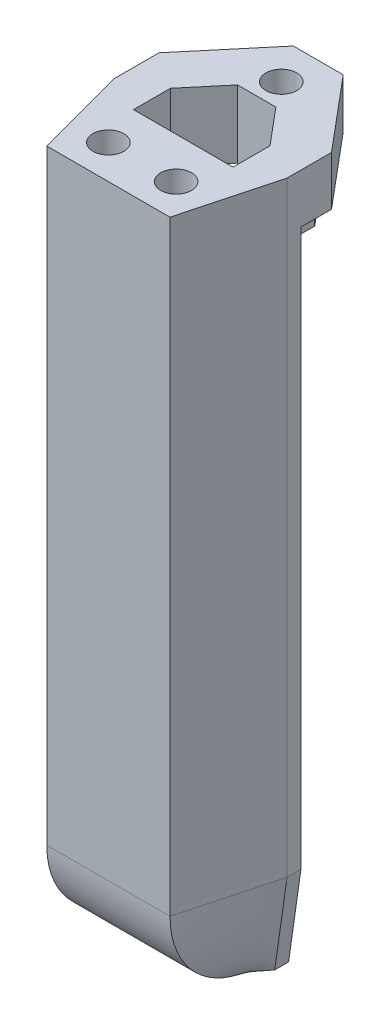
ISO-10303-21;
HEADER;
FILE_DESCRIPTION(('STEP AP214'),'2;1');
FILE_NAME('part.step','',(''),(''),'','','');
FILE_SCHEMA(('AUTOMOTIVE_DESIGN { 1 0 10303 214 1 1 1 1 }'));
ENDSEC;
DATA;
#1=APPLICATION_CONTEXT('core data for automotive mechanical design processes');
#2=APPLICATION_PROTOCOL_DEFINITION('international standard','automotive_design',2000,#1);
#3=PRODUCT_CONTEXT('',#1,'mechanical');
#4=PRODUCT('Part','Part','',(#3));
#5=PRODUCT_RELATED_PRODUCT_CATEGORY('part','',(#4));
#6=PRODUCT_DEFINITION_FORMATION('','',#4);
#7=PRODUCT_DEFINITION_CONTEXT('part definition',#1,'design');
#8=PRODUCT_DEFINITION('design','',#6,#7);
#9=PRODUCT_DEFINITION_SHAPE('','',#8);
#10=(LENGTH_UNIT() NAMED_UNIT(*) SI_UNIT(.MILLI.,.METRE.));
#11=(NAMED_UNIT(*) PLANE_ANGLE_UNIT() SI_UNIT($,.RADIAN.));
#12=(NAMED_UNIT(*) SI_UNIT($,.STERADIAN.) SOLID_ANGLE_UNIT());
#13=UNCERTAINTY_MEASURE_WITH_UNIT(LENGTH_MEASURE(1.E-05),#10,'distance_accuracy_value','');
#14=(GEOMETRIC_REPRESENTATION_CONTEXT(3) GLOBAL_UNCERTAINTY_ASSIGNED_CONTEXT((#13)) GLOBAL_UNIT_ASSIGNED_CONTEXT((#10,
#11,#12)) REPRESENTATION_CONTEXT('',''));
#15=CARTESIAN_POINT('',(0.,0.,0.));
#16=DIRECTION('',(0.,0.,1.));
#17=DIRECTION('',(1.,0.,0.));
#18=AXIS2_PLACEMENT_3D('',#15,#16,#17);
#19=CARTESIAN_POINT('',(77.2499999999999,4.26293488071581,0.));
#20=DIRECTION('',(0.,0.,1.));
#21=DIRECTION('',(1.,0.,0.));
#22=AXIS2_PLACEMENT_3D('',#19,#20,#21);
#23=PLANE('',#22);
#24=CARTESIAN_POINT('',(8.,2.26293488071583,0.));
#25=DIRECTION('',(0.,0.,-1.));
#26=DIRECTION('',(-1.,0.,0.));
#27=AXIS2_PLACEMENT_3D('',#24,#25,#26);
#28=CIRCLE('',#27,2.);
#29=CARTESIAN_POINT('',(6.,2.26293488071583,0.));
#30=VERTEX_POINT('',#29);
#31=EDGE_CURVE('E1932',#30,#30,#28,.T.);
#32=ORIENTED_EDGE('',*,*,#31,.F.);
#33=EDGE_LOOP('',(#32));
#34=FACE_BOUND('',#33,.T.);
#35=DIRECTION('',(-1.,0.,0.));
#36=VECTOR('',#35,1.);
#37=CARTESIAN_POINT('',(3.5,-0.710725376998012,0.));
#38=LINE('',#37,#36);
#39=CARTESIAN_POINT('',(3.5,-0.710725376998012,0.));
#40=VERTEX_POINT('',#39);
#41=CARTESIAN_POINT('',(-3.5,-0.710725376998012,0.));
#42=VERTEX_POINT('',#41);
#43=EDGE_CURVE('E1925',#40,#42,#38,.T.);
#44=ORIENTED_EDGE('',*,*,#43,.F.);
#45=DIRECTION('',(0.,-1.,0.));
#46=VECTOR('',#45,1.);
#47=CARTESIAN_POINT('',(3.5,-2.73706511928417,0.));
#48=LINE('',#47,#46);
#49=CARTESIAN_POINT('',(3.49999999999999,9.26293488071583,0.));
#50=VERTEX_POINT('',#49);
#51=EDGE_CURVE('E474',#50,#40,#48,.T.);
#52=ORIENTED_EDGE('',*,*,#51,.F.);
#53=DIRECTION('',(-1.,0.,0.));
#54=VECTOR('',#53,1.);
#55=CARTESIAN_POINT('',(3.49999999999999,9.26293488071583,0.));
#56=LINE('',#55,#54);
#57=CARTESIAN_POINT('',(12.,9.26293488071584,0.));
#58=VERTEX_POINT('',#57);
#59=EDGE_CURVE('E435',#58,#50,#56,.T.);
#60=ORIENTED_EDGE('',*,*,#59,.F.);
#61=DIRECTION('',(0.,-1.,0.));
#62=VECTOR('',#61,1.);
#63=CARTESIAN_POINT('',(12.,9.26293488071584,0.));
#64=LINE('',#63,#62);
#65=CARTESIAN_POINT('',(12.,4.26293488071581,0.));
#66=VERTEX_POINT('',#65);
#67=EDGE_CURVE('E507',#58,#66,#64,.T.);
#68=ORIENTED_EDGE('',*,*,#67,.T.);
#69=DIRECTION('',(0.334276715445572,0.942474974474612,0.));
#70=VECTOR('',#69,1.);
#71=CARTESIAN_POINT('',(10.,-1.37595607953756,0.));
#72=LINE('',#71,#70);
#73=CARTESIAN_POINT('',(10.,-1.37595607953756,0.));
#74=VERTEX_POINT('',#73);
#75=EDGE_CURVE('E662',#74,#66,#72,.T.);
#76=ORIENTED_EDGE('',*,*,#75,.F.);
#77=DIRECTION('',(0.,1.,0.));
#78=VECTOR('',#77,1.);
#79=CARTESIAN_POINT('',(10.,-9.77039845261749,0.));
#80=LINE('',#79,#78);
#81=CARTESIAN_POINT('',(10.,-9.73706511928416,0.));
#82=VERTEX_POINT('',#81);
#83=EDGE_CURVE('E1086',#82,#74,#80,.T.);
#84=ORIENTED_EDGE('',*,*,#83,.F.);
#85=DIRECTION('',(1.,0.,0.));
#86=VECTOR('',#85,1.);
#87=CARTESIAN_POINT('',(-9.99999999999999,-9.73706511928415,0.));
#88=LINE('',#87,#86);
#89=CARTESIAN_POINT('',(2.9,-9.73706511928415,0.));
#90=VERTEX_POINT('',#89);
#91=EDGE_CURVE('E119',#90,#82,#88,.T.);
#92=ORIENTED_EDGE('',*,*,#91,.F.);
#93=CARTESIAN_POINT('',(0.,-10.8878909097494,0.));
#94=DIRECTION('',(0.,0.,-1.));
#95=DIRECTION('',(1.,0.,0.));
#96=AXIS2_PLACEMENT_3D('',#93,#94,#95);
#97=CIRCLE('',#96,3.12);
#98=CARTESIAN_POINT('',(-2.9,-9.73706511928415,0.));
#99=VERTEX_POINT('',#98);
#100=EDGE_CURVE('E133',#99,#90,#97,.T.);
#101=ORIENTED_EDGE('',*,*,#100,.F.);
#102=CARTESIAN_POINT('',(-9.99999999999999,-9.73706511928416,0.));
#103=VERTEX_POINT('',#102);
#104=EDGE_CURVE('E528',#103,#99,#88,.T.);
#105=ORIENTED_EDGE('',*,*,#104,.F.);
#106=DIRECTION('',(0.,-1.,0.));
#107=VECTOR('',#106,1.);
#108=CARTESIAN_POINT('',(-10.,-1.37595607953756,0.));
#109=LINE('',#108,#107);
#110=CARTESIAN_POINT('',(-10.,-1.37595607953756,0.));
#111=VERTEX_POINT('',#110);
#112=EDGE_CURVE('E1057',#111,#103,#109,.T.);
#113=ORIENTED_EDGE('',*,*,#112,.F.);
#114=DIRECTION('',(0.334276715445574,-0.942474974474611,0.));
#115=VECTOR('',#114,1.);
#116=CARTESIAN_POINT('',(-12.,4.26293488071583,0.));
#117=LINE('',#116,#115);
#118=CARTESIAN_POINT('',(-12.,4.26293488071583,0.));
#119=VERTEX_POINT('',#118);
#120=EDGE_CURVE('E685',#119,#111,#117,.T.);
#121=ORIENTED_EDGE('',*,*,#120,.F.);
#122=DIRECTION('',(0.,-1.,0.));
#123=VECTOR('',#122,1.);
#124=CARTESIAN_POINT('',(-12.,9.26293488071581,0.));
#125=LINE('',#124,#123);
#126=CARTESIAN_POINT('',(-12.,9.26293488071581,0.));
#127=VERTEX_POINT('',#126);
#128=EDGE_CURVE('E455',#127,#119,#125,.T.);
#129=ORIENTED_EDGE('',*,*,#128,.F.);
#130=DIRECTION('',(-1.,0.,0.));
#131=VECTOR('',#130,1.);
#132=CARTESIAN_POINT('',(-12.,9.26293488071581,0.));
#133=LINE('',#132,#131);
#134=CARTESIAN_POINT('',(-3.5,9.26293488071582,0.));
#135=VERTEX_POINT('',#134);
#136=EDGE_CURVE('E444',#135,#127,#133,.T.);
#137=ORIENTED_EDGE('',*,*,#136,.F.);
#138=DIRECTION('',(0.,1.,0.));
#139=VECTOR('',#138,1.);
#140=CARTESIAN_POINT('',(-3.5,-2.73706511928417,0.));
#141=LINE('',#140,#139);
#142=EDGE_CURVE('E472',#42,#135,#141,.T.);
#143=ORIENTED_EDGE('',*,*,#142,.F.);
#144=EDGE_LOOP('',(#44,#52,#60,#68,#76,#84,#92,#101,#105,#113,#121,#129,#137,#143));
#145=FACE_BOUND('',#144,.T.);
#146=CARTESIAN_POINT('',(-8.,2.26293488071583,0.));
#147=DIRECTION('',(0.,0.,1.));
#148=DIRECTION('',(1.,0.,0.));
#149=AXIS2_PLACEMENT_3D('',#146,#147,#148);
#150=CIRCLE('',#149,2.);
#151=CARTESIAN_POINT('',(-6.,2.26293488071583,0.));
#152=VERTEX_POINT('',#151);
#153=EDGE_CURVE('E1926',#152,#152,#150,.T.);
#154=ORIENTED_EDGE('',*,*,#153,.T.);
#155=EDGE_LOOP('',(#154));
#156=FACE_BOUND('',#155,.T.);
#157=ADVANCED_FACE('F115',(#34,#145,#156),#23,.F.);
#158=CARTESIAN_POINT('',(77.2500000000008,4.26293488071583,-2.25));
#159=DIRECTION('',(0.,0.,1.));
#160=DIRECTION('',(1.,0.,0.));
#161=AXIS2_PLACEMENT_3D('',#158,#159,#160);
#162=PLANE('',#161);
#163=DIRECTION('',(0.,-1.,0.));
#164=VECTOR('',#163,1.);
#165=CARTESIAN_POINT('',(-12.,9.26293488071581,-2.25));
#166=LINE('',#165,#164);
#167=CARTESIAN_POINT('',(-12.0000000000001,91.5229348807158,-2.25));
#168=VERTEX_POINT('',#167);
#169=CARTESIAN_POINT('',(-12.,4.26293488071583,-2.25));
#170=VERTEX_POINT('',#169);
#171=EDGE_CURVE('E451',#168,#170,#166,.T.);
#172=ORIENTED_EDGE('',*,*,#171,.T.);
#173=DIRECTION('',(0.334276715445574,-0.942474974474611,0.));
#174=VECTOR('',#173,1.);
#175=CARTESIAN_POINT('',(-12.,4.26293488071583,-2.25));
#176=LINE('',#175,#174);
#177=CARTESIAN_POINT('',(-10.,-1.37595607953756,-2.25));
#178=VERTEX_POINT('',#177);
#179=EDGE_CURVE('E1103',#170,#178,#176,.T.);
#180=ORIENTED_EDGE('',*,*,#179,.T.);
#181=DIRECTION('',(0.,-1.,0.));
#182=VECTOR('',#181,1.);
#183=CARTESIAN_POINT('',(-10.,-1.37595607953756,-2.25));
#184=LINE('',#183,#182);
#185=CARTESIAN_POINT('',(-9.99999999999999,-9.77039845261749,-2.25));
#186=VERTEX_POINT('',#185);
#187=EDGE_CURVE('E1100',#178,#186,#184,.T.);
#188=ORIENTED_EDGE('',*,*,#187,.T.);
#189=DIRECTION('',(-1.,0.,0.));
#190=VECTOR('',#189,1.);
#191=CARTESIAN_POINT('',(-9.99999999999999,-9.77039845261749,-2.25));
#192=LINE('',#191,#190);
#193=CARTESIAN_POINT('',(-12.,-9.77039845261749,-2.25));
#194=VERTEX_POINT('',#193);
#195=EDGE_CURVE('E1095',#186,#194,#192,.T.);
#196=ORIENTED_EDGE('',*,*,#195,.T.);
#197=DIRECTION('',(-0.14109213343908,0.989996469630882,0.));
#198=VECTOR('',#197,1.);
#199=CARTESIAN_POINT('',(-12.,-9.77039845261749,-2.25));
#200=LINE('',#199,#198);
#201=CARTESIAN_POINT('',(-14.,4.26293488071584,-2.25));
#202=VERTEX_POINT('',#201);
#203=EDGE_CURVE('E1078',#194,#202,#200,.T.);
#204=ORIENTED_EDGE('',*,*,#203,.T.);
#205=DIRECTION('',(0.,-1.,0.));
#206=VECTOR('',#205,1.);
#207=CARTESIAN_POINT('',(-14.,9.26293488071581,-2.25));
#208=LINE('',#207,#206);
#209=CARTESIAN_POINT('',(-14.0000000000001,94.5229348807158,-2.24999999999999));
#210=VERTEX_POINT('',#209);
#211=EDGE_CURVE('E448',#210,#202,#208,.T.);
#212=ORIENTED_EDGE('',*,*,#211,.F.);
#213=DIRECTION('',(-1.,0.,0.));
#214=VECTOR('',#213,1.);
#215=CARTESIAN_POINT('',(-1.13524726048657E-13,94.5229348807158,-2.24999999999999));
#216=LINE('',#215,#214);
#217=CARTESIAN_POINT('',(-12.0000000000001,94.5229348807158,-2.24999999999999));
#218=VERTEX_POINT('',#217);
#219=EDGE_CURVE('E765',#218,#210,#216,.T.);
#220=ORIENTED_EDGE('',*,*,#219,.F.);
#221=EDGE_CURVE('E453',#218,#168,#166,.T.);
#222=ORIENTED_EDGE('',*,*,#221,.T.);
#223=EDGE_LOOP('',(#172,#180,#188,#196,#204,#212,#220,#222));
#224=FACE_BOUND('',#223,.T.);
#225=ADVANCED_FACE('F117',(#224),#162,.F.);
#226=CARTESIAN_POINT('',(-77.2500000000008,4.26293488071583,-2.25));
#227=DIRECTION('',(0.,0.,-1.));
#228=DIRECTION('',(-1.,0.,0.));
#229=AXIS2_PLACEMENT_3D('',#226,#227,#228);
#230=PLANE('',#229);
#231=DIRECTION('',(0.,-1.,0.));
#232=VECTOR('',#231,1.);
#233=CARTESIAN_POINT('',(14.,9.26293488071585,-2.25));
#234=LINE('',#233,#232);
#235=CARTESIAN_POINT('',(13.9999999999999,94.5229348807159,-2.24999999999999));
#236=VERTEX_POINT('',#235);
#237=CARTESIAN_POINT('',(13.9999999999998,4.26293488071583,-2.25));
#238=VERTEX_POINT('',#237);
#239=EDGE_CURVE('E458',#236,#238,#234,.T.);
#240=ORIENTED_EDGE('',*,*,#239,.T.);
#241=DIRECTION('',(-0.141092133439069,-0.989996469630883,0.));
#242=VECTOR('',#241,1.);
#243=CARTESIAN_POINT('',(13.9999999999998,4.26293488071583,-2.25));
#244=LINE('',#243,#242);
#245=CARTESIAN_POINT('',(12.,-9.77039845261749,-2.25));
#246=VERTEX_POINT('',#245);
#247=EDGE_CURVE('E1015',#238,#246,#244,.T.);
#248=ORIENTED_EDGE('',*,*,#247,.T.);
#249=DIRECTION('',(-1.,0.,0.));
#250=VECTOR('',#249,1.);
#251=CARTESIAN_POINT('',(12.,-9.77039845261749,-2.25));
#252=LINE('',#251,#250);
#253=CARTESIAN_POINT('',(10.,-9.77039845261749,-2.25));
#254=VERTEX_POINT('',#253);
#255=EDGE_CURVE('E657',#246,#254,#252,.T.);
#256=ORIENTED_EDGE('',*,*,#255,.T.);
#257=DIRECTION('',(0.,1.,0.));
#258=VECTOR('',#257,1.);
#259=CARTESIAN_POINT('',(10.,-9.77039845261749,-2.25));
#260=LINE('',#259,#258);
#261=CARTESIAN_POINT('',(10.,-1.37595607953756,-2.25));
#262=VERTEX_POINT('',#261);
#263=EDGE_CURVE('E654',#254,#262,#260,.T.);
#264=ORIENTED_EDGE('',*,*,#263,.T.);
#265=DIRECTION('',(0.334276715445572,0.942474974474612,0.));
#266=VECTOR('',#265,1.);
#267=CARTESIAN_POINT('',(10.,-1.37595607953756,-2.25));
#268=LINE('',#267,#266);
#269=CARTESIAN_POINT('',(12.,4.26293488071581,-2.25));
#270=VERTEX_POINT('',#269);
#271=EDGE_CURVE('E665',#262,#270,#268,.T.);
#272=ORIENTED_EDGE('',*,*,#271,.T.);
#273=DIRECTION('',(0.,-1.,0.));
#274=VECTOR('',#273,1.);
#275=CARTESIAN_POINT('',(12.,9.26293488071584,-2.25));
#276=LINE('',#275,#274);
#277=CARTESIAN_POINT('',(11.9999999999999,91.5229348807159,-2.25));
#278=VERTEX_POINT('',#277);
#279=EDGE_CURVE('E459',#278,#270,#276,.T.);
#280=ORIENTED_EDGE('',*,*,#279,.F.);
#281=CARTESIAN_POINT('',(11.9999999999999,94.5229348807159,-2.24999999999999));
#282=VERTEX_POINT('',#281);
#283=EDGE_CURVE('E456',#282,#278,#276,.T.);
#284=ORIENTED_EDGE('',*,*,#283,.F.);
#285=DIRECTION('',(-1.,0.,0.));
#286=VECTOR('',#285,1.);
#287=CARTESIAN_POINT('',(-1.13524726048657E-13,94.5229348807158,-2.24999999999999));
#288=LINE('',#287,#286);
#289=EDGE_CURVE('E779',#236,#282,#288,.T.);
#290=ORIENTED_EDGE('',*,*,#289,.F.);
#291=EDGE_LOOP('',(#240,#248,#256,#264,#272,#280,#284,#290));
#292=FACE_BOUND('',#291,.T.);
#293=ADVANCED_FACE('F1012',(#292),#230,.T.);
#294=CARTESIAN_POINT('',(0.,0.,8.));
#295=DIRECTION('',(0.,0.,-1.));
#296=DIRECTION('',(-1.,0.,0.));
#297=AXIS2_PLACEMENT_3D('',#294,#295,#296);
#298=PLANE('',#297);
#299=CARTESIAN_POINT('',(0.,25.5229348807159,8.));
#300=DIRECTION('',(0.,0.,-1.));
#301=DIRECTION('',(-1.,0.,0.));
#302=AXIS2_PLACEMENT_3D('',#299,#300,#301);
#303=CIRCLE('',#302,3.5);
#304=CARTESIAN_POINT('',(-3.5,25.5229348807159,8.));
#305=VERTEX_POINT('',#304);
#306=EDGE_CURVE('E741',#305,#305,#303,.T.);
#307=ORIENTED_EDGE('',*,*,#306,.F.);
#308=EDGE_LOOP('',(#307));
#309=FACE_BOUND('',#308,.T.);
#310=DIRECTION('',(0.,-1.,0.));
#311=VECTOR('',#310,1.);
#312=CARTESIAN_POINT('',(3.5,-2.73706511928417,8.));
#313=LINE('',#312,#311);
#314=CARTESIAN_POINT('',(3.5,9.26293488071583,8.));
#315=VERTEX_POINT('',#314);
#316=CARTESIAN_POINT('',(3.5,-0.710725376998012,8.));
#317=VERTEX_POINT('',#316);
#318=EDGE_CURVE('E468',#315,#317,#313,.T.);
#319=ORIENTED_EDGE('',*,*,#318,.T.);
#320=DIRECTION('',(1.,0.,0.));
#321=VECTOR('',#320,1.);
#322=CARTESIAN_POINT('',(3.5,-0.710725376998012,8.));
#323=LINE('',#322,#321);
#324=CARTESIAN_POINT('',(-3.5,-0.710725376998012,8.));
#325=VERTEX_POINT('',#324);
#326=EDGE_CURVE('E1068',#325,#317,#323,.T.);
#327=ORIENTED_EDGE('',*,*,#326,.F.);
#328=DIRECTION('',(0.,1.,0.));
#329=VECTOR('',#328,1.);
#330=CARTESIAN_POINT('',(-3.5,-2.73706511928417,8.));
#331=LINE('',#330,#329);
#332=CARTESIAN_POINT('',(-3.5,9.26293488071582,8.));
#333=VERTEX_POINT('',#332);
#334=EDGE_CURVE('E471',#325,#333,#331,.T.);
#335=ORIENTED_EDGE('',*,*,#334,.T.);
#336=DIRECTION('',(-1.,0.,0.));
#337=VECTOR('',#336,1.);
#338=CARTESIAN_POINT('',(8.,9.26293488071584,8.));
#339=LINE('',#338,#337);
#340=CARTESIAN_POINT('',(-8.00000000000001,9.26293488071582,8.));
#341=VERTEX_POINT('',#340);
#342=EDGE_CURVE('E125',#333,#341,#339,.T.);
#343=ORIENTED_EDGE('',*,*,#342,.T.);
#344=DIRECTION('',(0.,-1.,0.));
#345=VECTOR('',#344,1.);
#346=CARTESIAN_POINT('',(-8.00000000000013,102.522934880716,8.));
#347=LINE('',#346,#345);
#348=CARTESIAN_POINT('',(-8.00000000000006,47.5229348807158,8.));
#349=VERTEX_POINT('',#348);
#350=EDGE_CURVE('E429',#349,#341,#347,.T.);
#351=ORIENTED_EDGE('',*,*,#350,.F.);
#352=DIRECTION('',(1.,0.,0.));
#353=VECTOR('',#352,1.);
#354=CARTESIAN_POINT('',(0.,47.5229348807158,8.));
#355=LINE('',#354,#353);
#356=CARTESIAN_POINT('',(8.,47.5229348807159,8.));
#357=VERTEX_POINT('',#356);
#358=EDGE_CURVE('E397',#349,#357,#355,.T.);
#359=ORIENTED_EDGE('',*,*,#358,.T.);
#360=DIRECTION('',(0.,-1.,0.));
#361=VECTOR('',#360,1.);
#362=CARTESIAN_POINT('',(7.99999999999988,102.522934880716,8.));
#363=LINE('',#362,#361);
#364=CARTESIAN_POINT('',(8.,9.26293488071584,8.));
#365=VERTEX_POINT('',#364);
#366=EDGE_CURVE('E431',#357,#365,#363,.T.);
#367=ORIENTED_EDGE('',*,*,#366,.T.);
#368=EDGE_CURVE('E423',#365,#315,#339,.T.);
#369=ORIENTED_EDGE('',*,*,#368,.T.);
#370=EDGE_LOOP('',(#319,#327,#335,#343,#351,#359,#367,#369));
#371=FACE_BOUND('',#370,.T.);
#372=ADVANCED_FACE('F930',(#309,#371),#298,.T.);
#373=CARTESIAN_POINT('',(3.5,-2.73706511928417,8.));
#374=DIRECTION('',(1.,0.,0.));
#375=DIRECTION('',(0.,1.,0.));
#376=AXIS2_PLACEMENT_3D('',#373,#374,#375);
#377=PLANE('',#376);
#378=ORIENTED_EDGE('',*,*,#51,.T.);
#379=DIRECTION('',(0.,0.,-1.));
#380=VECTOR('',#379,1.);
#381=CARTESIAN_POINT('',(3.5,-0.710725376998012,16.5870423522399));
#382=LINE('',#381,#380);
#383=EDGE_CURVE('E1929',#317,#40,#382,.T.);
#384=ORIENTED_EDGE('',*,*,#383,.F.);
#385=ORIENTED_EDGE('',*,*,#318,.F.);
#386=DIRECTION('',(0.,0.,1.));
#387=VECTOR('',#386,1.);
#388=CARTESIAN_POINT('',(3.5,9.26293488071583,8.));
#389=LINE('',#388,#387);
#390=EDGE_CURVE('E438',#50,#315,#389,.T.);
#391=ORIENTED_EDGE('',*,*,#390,.F.);
#392=EDGE_LOOP('',(#378,#384,#385,#391));
#393=FACE_BOUND('',#392,.T.);
#394=ADVANCED_FACE('F1213',(#393),#377,.F.);
#395=CARTESIAN_POINT('',(-3.5,-2.73706511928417,8.));
#396=DIRECTION('',(-1.,0.,0.));
#397=DIRECTION('',(0.,-1.,0.));
#398=AXIS2_PLACEMENT_3D('',#395,#396,#397);
#399=PLANE('',#398);
#400=ORIENTED_EDGE('',*,*,#334,.F.);
#401=DIRECTION('',(0.,0.,-1.));
#402=VECTOR('',#401,1.);
#403=CARTESIAN_POINT('',(-3.5,-0.710725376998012,16.5870423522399));
#404=LINE('',#403,#402);
#405=EDGE_CURVE('E1940',#325,#42,#404,.T.);
#406=ORIENTED_EDGE('',*,*,#405,.T.);
#407=ORIENTED_EDGE('',*,*,#142,.T.);
#408=DIRECTION('',(0.,0.,-1.));
#409=VECTOR('',#408,1.);
#410=CARTESIAN_POINT('',(-3.5,9.26293488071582,0.));
#411=LINE('',#410,#409);
#412=EDGE_CURVE('E441',#333,#135,#411,.T.);
#413=ORIENTED_EDGE('',*,*,#412,.F.);
#414=EDGE_LOOP('',(#400,#406,#407,#413));
#415=FACE_BOUND('',#414,.T.);
#416=ADVANCED_FACE('F1216',(#415),#399,.F.);
#417=CARTESIAN_POINT('',(-12.0000000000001,91.5229348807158,0.));
#418=DIRECTION('',(1.,0.,0.));
#419=DIRECTION('',(0.,1.,0.));
#420=AXIS2_PLACEMENT_3D('',#417,#418,#419);
#421=PLANE('',#420);
#422=DIRECTION('',(0.,0.,-1.));
#423=VECTOR('',#422,1.);
#424=CARTESIAN_POINT('',(-12.0000000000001,94.5229348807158,0.));
#425=LINE('',#424,#423);
#426=CARTESIAN_POINT('',(-12.0000000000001,94.5229348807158,-6.47874598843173));
#427=VERTEX_POINT('',#426);
#428=EDGE_CURVE('E767',#218,#427,#425,.T.);
#429=ORIENTED_EDGE('',*,*,#428,.T.);
#430=DIRECTION('',(0.,1.,0.));
#431=VECTOR('',#430,1.);
#432=CARTESIAN_POINT('',(-12.0000000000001,91.5229348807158,-6.47874598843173));
#433=LINE('',#432,#431);
#434=CARTESIAN_POINT('',(-12.0000000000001,91.5229348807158,-6.47874598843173));
#435=VERTEX_POINT('',#434);
#436=EDGE_CURVE('E874',#435,#427,#433,.T.);
#437=ORIENTED_EDGE('',*,*,#436,.F.);
#438=DIRECTION('',(0.,0.,-1.));
#439=VECTOR('',#438,1.);
#440=CARTESIAN_POINT('',(-12.0000000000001,91.5229348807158,0.));
#441=LINE('',#440,#439);
#442=EDGE_CURVE('E814',#168,#435,#441,.T.);
#443=ORIENTED_EDGE('',*,*,#442,.F.);
#444=ORIENTED_EDGE('',*,*,#221,.F.);
#445=EDGE_LOOP('',(#429,#437,#443,#444));
#446=FACE_BOUND('',#445,.T.);
#447=ADVANCED_FACE('F1172',(#446),#421,.F.);
#448=CARTESIAN_POINT('',(10.2320487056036,91.5229348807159,-8.58570829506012));
#449=DIRECTION('',(0.766044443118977,0.,-0.642787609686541));
#450=DIRECTION('',(-0.64278760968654,0.,-0.766044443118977));
#451=AXIS2_PLACEMENT_3D('',#448,#449,#450);
#452=PLANE('',#451);
#453=DIRECTION('',(0.,1.,0.));
#454=VECTOR('',#453,1.);
#455=CARTESIAN_POINT('',(3.11540602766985,91.5229348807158,-17.0669927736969));
#456=LINE('',#455,#454);
#457=CARTESIAN_POINT('',(3.11540602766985,91.5229348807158,-17.0669927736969));
#458=VERTEX_POINT('',#457);
#459=CARTESIAN_POINT('',(3.11540602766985,94.5229348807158,-17.0669927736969));
#460=VERTEX_POINT('',#459);
#461=EDGE_CURVE('E843',#458,#460,#456,.T.);
#462=ORIENTED_EDGE('',*,*,#461,.T.);
#463=DIRECTION('',(-0.64278760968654,0.,-0.766044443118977));
#464=VECTOR('',#463,1.);
#465=CARTESIAN_POINT('',(10.2320487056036,94.5229348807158,-8.58570829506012));
#466=LINE('',#465,#464);
#467=CARTESIAN_POINT('',(11.9999999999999,94.5229348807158,-6.47874598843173));
#468=VERTEX_POINT('',#467);
#469=EDGE_CURVE('E775',#468,#460,#466,.T.);
#470=ORIENTED_EDGE('',*,*,#469,.F.);
#471=DIRECTION('',(0.,1.,0.));
#472=VECTOR('',#471,1.);
#473=CARTESIAN_POINT('',(11.9999999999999,91.5229348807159,-6.47874598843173));
#474=LINE('',#473,#472);
#475=CARTESIAN_POINT('',(11.9999999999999,91.5229348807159,-6.47874598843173));
#476=VERTEX_POINT('',#475);
#477=EDGE_CURVE('E856',#476,#468,#474,.T.);
#478=ORIENTED_EDGE('',*,*,#477,.F.);
#479=DIRECTION('',(-0.64278760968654,0.,-0.766044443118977));
#480=VECTOR('',#479,1.);
#481=CARTESIAN_POINT('',(10.2320487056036,91.5229348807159,-8.58570829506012));
#482=LINE('',#481,#480);
#483=EDGE_CURVE('E805',#476,#458,#482,.T.);
#484=ORIENTED_EDGE('',*,*,#483,.T.);
#485=EDGE_LOOP('',(#462,#470,#478,#484));
#486=FACE_BOUND('',#485,.T.);
#487=ADVANCED_FACE('F1290',(#486),#452,.T.);
#488=CARTESIAN_POINT('',(11.9999999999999,91.5229348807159,-2.03667193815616E-13));
#489=DIRECTION('',(-1.,0.,0.));
#490=DIRECTION('',(0.,0.,1.));
#491=AXIS2_PLACEMENT_3D('',#488,#489,#490);
#492=PLANE('',#491);
#493=DIRECTION('',(0.,0.,-1.));
#494=VECTOR('',#493,1.);
#495=CARTESIAN_POINT('',(11.9999999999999,94.5229348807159,0.));
#496=LINE('',#495,#494);
#497=EDGE_CURVE('E777',#282,#468,#496,.T.);
#498=ORIENTED_EDGE('',*,*,#497,.F.);
#499=ORIENTED_EDGE('',*,*,#283,.T.);
#500=DIRECTION('',(0.,0.,1.));
#501=VECTOR('',#500,1.);
#502=CARTESIAN_POINT('',(11.9999999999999,91.5229348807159,-2.03667193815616E-13));
#503=LINE('',#502,#501);
#504=EDGE_CURVE('E840',#476,#278,#503,.T.);
#505=ORIENTED_EDGE('',*,*,#504,.F.);
#506=ORIENTED_EDGE('',*,*,#477,.T.);
#507=EDGE_LOOP('',(#498,#499,#505,#506));
#508=FACE_BOUND('',#507,.T.);
#509=ADVANCED_FACE('F1026',(#508),#492,.F.);
#510=CARTESIAN_POINT('',(-10.2320487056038,91.5229348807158,-8.58570829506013));
#511=DIRECTION('',(0.766044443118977,0.,0.642787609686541));
#512=DIRECTION('',(0.64278760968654,0.,-0.766044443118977));
#513=AXIS2_PLACEMENT_3D('',#510,#511,#512);
#514=PLANE('',#513);
#515=DIRECTION('',(0.64278760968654,0.,-0.766044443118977));
#516=VECTOR('',#515,1.);
#517=CARTESIAN_POINT('',(-10.2320487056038,94.5229348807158,-8.58570829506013));
#518=LINE('',#517,#516);
#519=CARTESIAN_POINT('',(-3.1154060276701,94.5229348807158,-17.0669927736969));
#520=VERTEX_POINT('',#519);
#521=EDGE_CURVE('E770',#427,#520,#518,.T.);
#522=ORIENTED_EDGE('',*,*,#521,.T.);
#523=DIRECTION('',(0.,1.,0.));
#524=VECTOR('',#523,1.);
#525=CARTESIAN_POINT('',(-3.1154060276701,91.5229348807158,-17.0669927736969));
#526=LINE('',#525,#524);
#527=CARTESIAN_POINT('',(-3.1154060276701,91.5229348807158,-17.0669927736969));
#528=VERTEX_POINT('',#527);
#529=EDGE_CURVE('E877',#528,#520,#526,.T.);
#530=ORIENTED_EDGE('',*,*,#529,.F.);
#531=DIRECTION('',(0.64278760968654,0.,-0.766044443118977));
#532=VECTOR('',#531,1.);
#533=CARTESIAN_POINT('',(-10.2320487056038,91.5229348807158,-8.58570829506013));
#534=LINE('',#533,#532);
#535=EDGE_CURVE('E812',#435,#528,#534,.T.);
#536=ORIENTED_EDGE('',*,*,#535,.F.);
#537=ORIENTED_EDGE('',*,*,#436,.T.);
#538=EDGE_LOOP('',(#522,#530,#536,#537));
#539=FACE_BOUND('',#538,.T.);
#540=ADVANCED_FACE('F1296',(#539),#514,.F.);
#541=CARTESIAN_POINT('',(-1.09621598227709E-13,91.5229348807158,-17.0669927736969));
#542=DIRECTION('',(0.,0.,-1.));
#543=DIRECTION('',(0.,1.,0.));
#544=AXIS2_PLACEMENT_3D('',#541,#542,#543);
#545=PLANE('',#544);
#546=ORIENTED_EDGE('',*,*,#529,.T.);
#547=DIRECTION('',(-1.,0.,0.));
#548=VECTOR('',#547,1.);
#549=CARTESIAN_POINT('',(-1.13524726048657E-13,94.5229348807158,-17.0669927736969));
#550=LINE('',#549,#548);
#551=EDGE_CURVE('E773',#460,#520,#550,.T.);
#552=ORIENTED_EDGE('',*,*,#551,.F.);
#553=ORIENTED_EDGE('',*,*,#461,.F.);
#554=DIRECTION('',(-1.,0.,0.));
#555=VECTOR('',#554,1.);
#556=CARTESIAN_POINT('',(-1.09621598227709E-13,91.5229348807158,-17.0669927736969));
#557=LINE('',#556,#555);
#558=EDGE_CURVE('E808',#458,#528,#557,.T.);
#559=ORIENTED_EDGE('',*,*,#558,.T.);
#560=EDGE_LOOP('',(#546,#552,#553,#559));
#561=FACE_BOUND('',#560,.T.);
#562=ADVANCED_FACE('F1230',(#561),#545,.T.);
#563=CARTESIAN_POINT('',(12.,9.26293488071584,-2.25));
#564=DIRECTION('',(1.,0.,0.));
#565=DIRECTION('',(0.,1.,0.));
#566=AXIS2_PLACEMENT_3D('',#563,#564,#565);
#567=PLANE('',#566);
#568=CARTESIAN_POINT('',(11.9999999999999,91.5229348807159,0.));
#569=VERTEX_POINT('',#568);
#570=EDGE_CURVE('E839',#278,#569,#503,.T.);
#571=ORIENTED_EDGE('',*,*,#570,.F.);
#572=ORIENTED_EDGE('',*,*,#279,.T.);
#573=DIRECTION('',(0.,0.,1.));
#574=VECTOR('',#573,1.);
#575=CARTESIAN_POINT('',(12.,4.26293488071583,-2.25));
#576=LINE('',#575,#574);
#577=EDGE_CURVE('E465',#270,#66,#576,.T.);
#578=ORIENTED_EDGE('',*,*,#577,.T.);
#579=ORIENTED_EDGE('',*,*,#67,.F.);
#580=DIRECTION('',(0.,-1.,0.));
#581=VECTOR('',#580,1.);
#582=CARTESIAN_POINT('',(11.9999999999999,102.522934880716,0.));
#583=LINE('',#582,#581);
#584=EDGE_CURVE('E433',#569,#58,#583,.T.);
#585=ORIENTED_EDGE('',*,*,#584,.F.);
#586=EDGE_LOOP('',(#571,#572,#578,#579,#585));
#587=FACE_BOUND('',#586,.T.);
#588=ADVANCED_FACE('F1018',(#587),#567,.F.);
#589=CARTESIAN_POINT('',(-12.,9.26293488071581,0.));
#590=DIRECTION('',(-1.,0.,0.));
#591=DIRECTION('',(0.,0.,1.));
#592=AXIS2_PLACEMENT_3D('',#589,#590,#591);
#593=PLANE('',#592);
#594=CARTESIAN_POINT('',(-12.0000000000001,91.5229348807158,0.));
#595=VERTEX_POINT('',#594);
#596=EDGE_CURVE('E815',#595,#168,#441,.T.);
#597=ORIENTED_EDGE('',*,*,#596,.F.);
#598=DIRECTION('',(0.,-1.,0.));
#599=VECTOR('',#598,1.);
#600=CARTESIAN_POINT('',(-12.0000000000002,102.522934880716,0.));
#601=LINE('',#600,#599);
#602=EDGE_CURVE('E420',#595,#127,#601,.T.);
#603=ORIENTED_EDGE('',*,*,#602,.T.);
#604=ORIENTED_EDGE('',*,*,#128,.T.);
#605=DIRECTION('',(0.,0.,1.));
#606=VECTOR('',#605,1.);
#607=CARTESIAN_POINT('',(-12.,4.26293488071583,-2.25));
#608=LINE('',#607,#606);
#609=EDGE_CURVE('E488',#170,#119,#608,.T.);
#610=ORIENTED_EDGE('',*,*,#609,.F.);
#611=ORIENTED_EDGE('',*,*,#171,.F.);
#612=EDGE_LOOP('',(#597,#603,#604,#610,#611));
#613=FACE_BOUND('',#612,.T.);
#614=ADVANCED_FACE('F955',(#613),#593,.F.);
#615=CARTESIAN_POINT('',(7.99999999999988,102.522934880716,8.));
#616=DIRECTION('',(0.894427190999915,0.,0.44721359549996));
#617=DIRECTION('',(0.44721359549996,0.,-0.894427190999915));
#618=AXIS2_PLACEMENT_3D('',#615,#616,#617);
#619=PLANE('',#618);
#620=DIRECTION('',(-0.44721359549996,0.,0.894427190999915));
#621=VECTOR('',#620,1.);
#622=CARTESIAN_POINT('',(9.59999999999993,91.5229348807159,4.79999999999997));
#623=LINE('',#622,#621);
#624=CARTESIAN_POINT('',(10.576998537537,91.5229348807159,2.84600292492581));
#625=VERTEX_POINT('',#624);
#626=EDGE_CURVE('E837',#569,#625,#623,.T.);
#627=ORIENTED_EDGE('',*,*,#626,.F.);
#628=ORIENTED_EDGE('',*,*,#584,.T.);
#629=DIRECTION('',(-0.44721359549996,0.,0.894427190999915));
#630=VECTOR('',#629,1.);
#631=CARTESIAN_POINT('',(8.,9.26293488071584,8.));
#632=LINE('',#631,#630);
#633=EDGE_CURVE('E404',#58,#365,#632,.T.);
#634=ORIENTED_EDGE('',*,*,#633,.T.);
#635=ORIENTED_EDGE('',*,*,#366,.F.);
#636=DIRECTION('',(-0.44721359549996,0.,0.894427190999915));
#637=VECTOR('',#636,1.);
#638=CARTESIAN_POINT('',(7.99999999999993,47.5229348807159,8.00000000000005));
#639=LINE('',#638,#637);
#640=CARTESIAN_POINT('',(10.5769985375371,47.5229348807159,2.84600292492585));
#641=VERTEX_POINT('',#640);
#642=EDGE_CURVE('E402',#641,#357,#639,.T.);
#643=ORIENTED_EDGE('',*,*,#642,.F.);
#644=DIRECTION('',(0.,1.,0.));
#645=VECTOR('',#644,1.);
#646=CARTESIAN_POINT('',(10.5769985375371,47.5229348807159,2.84600292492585));
#647=LINE('',#646,#645);
#648=EDGE_CURVE('E389',#641,#625,#647,.T.);
#649=ORIENTED_EDGE('',*,*,#648,.T.);
#650=EDGE_LOOP('',(#627,#628,#634,#635,#643,#649));
#651=FACE_BOUND('',#650,.T.);
#652=ADVANCED_FACE('F925',(#651),#619,.F.);
#653=CARTESIAN_POINT('',(-8.00000000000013,102.522934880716,8.));
#654=DIRECTION('',(-0.894427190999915,0.,0.44721359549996));
#655=DIRECTION('',(0.44721359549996,0.,0.894427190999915));
#656=AXIS2_PLACEMENT_3D('',#653,#654,#655);
#657=PLANE('',#656);
#658=DIRECTION('',(-0.44721359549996,0.,-0.894427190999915));
#659=VECTOR('',#658,1.);
#660=CARTESIAN_POINT('',(-9.60000000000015,91.5229348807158,4.79999999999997));
#661=LINE('',#660,#659);
#662=CARTESIAN_POINT('',(-10.5769985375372,91.5229348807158,2.84600292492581));
#663=VERTEX_POINT('',#662);
#664=EDGE_CURVE('E818',#663,#595,#661,.T.);
#665=ORIENTED_EDGE('',*,*,#664,.F.);
#666=DIRECTION('',(0.,1.,0.));
#667=VECTOR('',#666,1.);
#668=CARTESIAN_POINT('',(-10.5769985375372,47.5229348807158,2.84600292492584));
#669=LINE('',#668,#667);
#670=CARTESIAN_POINT('',(-10.5769985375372,47.5229348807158,2.84600292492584));
#671=VERTEX_POINT('',#670);
#672=EDGE_CURVE('E395',#671,#663,#669,.T.);
#673=ORIENTED_EDGE('',*,*,#672,.F.);
#674=DIRECTION('',(-0.44721359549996,0.,-0.894427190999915));
#675=VECTOR('',#674,1.);
#676=CARTESIAN_POINT('',(-8.00000000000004,47.5229348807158,8.00000000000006));
#677=LINE('',#676,#675);
#678=EDGE_CURVE('E12',#349,#671,#677,.T.);
#679=ORIENTED_EDGE('',*,*,#678,.F.);
#680=ORIENTED_EDGE('',*,*,#350,.T.);
#681=DIRECTION('',(-0.44721359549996,0.,-0.894427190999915));
#682=VECTOR('',#681,1.);
#683=CARTESIAN_POINT('',(-8.00000000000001,9.26293488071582,8.));
#684=LINE('',#683,#682);
#685=EDGE_CURVE('E409',#341,#127,#684,.T.);
#686=ORIENTED_EDGE('',*,*,#685,.T.);
#687=ORIENTED_EDGE('',*,*,#602,.F.);
#688=EDGE_LOOP('',(#665,#673,#679,#680,#686,#687));
#689=FACE_BOUND('',#688,.T.);
#690=ADVANCED_FACE('F937',(#689),#657,.F.);
#691=CARTESIAN_POINT('',(10.5769985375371,47.5229348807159,2.84600292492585));
#692=DIRECTION('',(0.,0.,-1.));
#693=DIRECTION('',(0.,1.,0.));
#694=AXIS2_PLACEMENT_3D('',#691,#692,#693);
#695=PLANE('',#694);
#696=DIRECTION('',(0.,1.,0.));
#697=VECTOR('',#696,1.);
#698=CARTESIAN_POINT('',(-8.07699853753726,91.5229348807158,2.84600292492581));
#699=LINE('',#698,#697);
#700=CARTESIAN_POINT('',(-8.07699853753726,91.5229348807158,2.84600292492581));
#701=VERTEX_POINT('',#700);
#702=CARTESIAN_POINT('',(-8.07699853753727,102.522934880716,2.8460029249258));
#703=VERTEX_POINT('',#702);
#704=EDGE_CURVE('E872',#701,#703,#699,.T.);
#705=ORIENTED_EDGE('',*,*,#704,.T.);
#706=DIRECTION('',(-1.,0.,0.));
#707=VECTOR('',#706,1.);
#708=CARTESIAN_POINT('',(10.576998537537,102.522934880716,2.8460029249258));
#709=LINE('',#708,#707);
#710=CARTESIAN_POINT('',(8.07699853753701,102.522934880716,2.8460029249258));
#711=VERTEX_POINT('',#710);
#712=EDGE_CURVE('E386',#711,#703,#709,.T.);
#713=ORIENTED_EDGE('',*,*,#712,.F.);
#714=DIRECTION('',(0.,1.,0.));
#715=VECTOR('',#714,1.);
#716=CARTESIAN_POINT('',(8.07699853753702,91.5229348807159,2.84600292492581));
#717=LINE('',#716,#715);
#718=CARTESIAN_POINT('',(8.07699853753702,91.5229348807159,2.84600292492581));
#719=VERTEX_POINT('',#718);
#720=EDGE_CURVE('E860',#719,#711,#717,.T.);
#721=ORIENTED_EDGE('',*,*,#720,.F.);
#722=DIRECTION('',(-1.,0.,0.));
#723=VECTOR('',#722,1.);
#724=CARTESIAN_POINT('',(-1.09796637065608E-13,91.5229348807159,2.84600292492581));
#725=LINE('',#724,#723);
#726=EDGE_CURVE('E835',#625,#719,#725,.T.);
#727=ORIENTED_EDGE('',*,*,#726,.F.);
#728=ORIENTED_EDGE('',*,*,#648,.F.);
#729=DIRECTION('',(-1.,0.,0.));
#730=VECTOR('',#729,1.);
#731=CARTESIAN_POINT('',(10.5769985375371,47.5229348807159,2.84600292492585));
#732=LINE('',#731,#730);
#733=CARTESIAN_POINT('',(8.,47.5229348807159,2.84600292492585));
#734=VERTEX_POINT('',#733);
#735=EDGE_CURVE('E385',#641,#734,#732,.T.);
#736=ORIENTED_EDGE('',*,*,#735,.T.);
#737=DIRECTION('',(0.,-1.,0.));
#738=VECTOR('',#737,1.);
#739=CARTESIAN_POINT('',(8.,47.5229348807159,2.84600292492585));
#740=LINE('',#739,#738);
#741=CARTESIAN_POINT('',(8.,78.5229348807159,2.84600292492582));
#742=VERTEX_POINT('',#741);
#743=EDGE_CURVE('E380',#742,#734,#740,.T.);
#744=ORIENTED_EDGE('',*,*,#743,.F.);
#745=DIRECTION('',(1.,0.,0.));
#746=VECTOR('',#745,1.);
#747=CARTESIAN_POINT('',(8.,78.5229348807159,2.84600292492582));
#748=LINE('',#747,#746);
#749=CARTESIAN_POINT('',(-8.,78.5229348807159,2.84600292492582));
#750=VERTEX_POINT('',#749);
#751=EDGE_CURVE('E379',#750,#742,#748,.T.);
#752=ORIENTED_EDGE('',*,*,#751,.F.);
#753=DIRECTION('',(0.,1.,0.));
#754=VECTOR('',#753,1.);
#755=CARTESIAN_POINT('',(-8.,47.5229348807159,2.84600292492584));
#756=LINE('',#755,#754);
#757=CARTESIAN_POINT('',(-7.99999999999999,47.5229348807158,2.84600292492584));
#758=VERTEX_POINT('',#757);
#759=EDGE_CURVE('E361',#758,#750,#756,.T.);
#760=ORIENTED_EDGE('',*,*,#759,.F.);
#761=EDGE_CURVE('E376',#758,#671,#732,.T.);
#762=ORIENTED_EDGE('',*,*,#761,.T.);
#763=ORIENTED_EDGE('',*,*,#672,.T.);
#764=DIRECTION('',(-1.,0.,0.));
#765=VECTOR('',#764,1.);
#766=CARTESIAN_POINT('',(-1.09796637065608E-13,91.5229348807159,2.84600292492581));
#767=LINE('',#766,#765);
#768=EDGE_CURVE('E820',#701,#663,#767,.T.);
#769=ORIENTED_EDGE('',*,*,#768,.F.);
#770=EDGE_LOOP('',(#705,#713,#721,#727,#728,#736,#744,#752,#760,#762,#763,#769));
#771=FACE_BOUND('',#770,.T.);
#772=ADVANCED_FACE('F374',(#771),#695,.T.);
#773=CARTESIAN_POINT('',(0.,9.26293488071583,0.));
#774=DIRECTION('',(0.,1.,0.));
#775=DIRECTION('',(-1.,0.,0.));
#776=AXIS2_PLACEMENT_3D('',#773,#774,#775);
#777=PLANE('',#776);
#778=ORIENTED_EDGE('',*,*,#685,.F.);
#779=ORIENTED_EDGE('',*,*,#342,.F.);
#780=ORIENTED_EDGE('',*,*,#412,.T.);
#781=ORIENTED_EDGE('',*,*,#136,.T.);
#782=EDGE_LOOP('',(#778,#779,#780,#781));
#783=FACE_BOUND('',#782,.T.);
#784=ADVANCED_FACE('F940',(#783),#777,.T.);
#785=CARTESIAN_POINT('',(14.,9.26293488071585,0.));
#786=DIRECTION('',(-1.,0.,0.));
#787=DIRECTION('',(0.,-1.,0.));
#788=AXIS2_PLACEMENT_3D('',#785,#786,#787);
#789=PLANE('',#788);
#790=DIRECTION('',(0.,0.,1.));
#791=VECTOR('',#790,1.);
#792=CARTESIAN_POINT('',(14.,4.26293488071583,-2.25));
#793=LINE('',#792,#791);
#794=CARTESIAN_POINT('',(13.9999999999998,4.26293488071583,0.));
#795=VERTEX_POINT('',#794);
#796=EDGE_CURVE('E462',#238,#795,#793,.T.);
#797=ORIENTED_EDGE('',*,*,#796,.F.);
#798=ORIENTED_EDGE('',*,*,#239,.F.);
#799=DIRECTION('',(0.,0.,1.));
#800=VECTOR('',#799,1.);
#801=CARTESIAN_POINT('',(13.9999999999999,94.5229348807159,0.));
#802=LINE('',#801,#800);
#803=CARTESIAN_POINT('',(13.9999999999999,94.5229348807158,-7.20668645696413));
#804=VERTEX_POINT('',#803);
#805=EDGE_CURVE('E751',#804,#236,#802,.T.);
#806=ORIENTED_EDGE('',*,*,#805,.F.);
#807=DIRECTION('',(0.,1.,0.));
#808=VECTOR('',#807,1.);
#809=CARTESIAN_POINT('',(13.9999999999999,94.5229348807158,-7.20668645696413));
#810=LINE('',#809,#808);
#811=CARTESIAN_POINT('',(13.9999999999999,102.522934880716,-7.20668645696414));
#812=VERTEX_POINT('',#811);
#813=EDGE_CURVE('E781',#804,#812,#810,.T.);
#814=ORIENTED_EDGE('',*,*,#813,.T.);
#815=DIRECTION('',(0.,0.,-1.));
#816=VECTOR('',#815,1.);
#817=CARTESIAN_POINT('',(13.9999999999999,102.522934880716,-2.25));
#818=LINE('',#817,#816);
#819=CARTESIAN_POINT('',(13.9999999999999,102.522934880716,0.));
#820=VERTEX_POINT('',#819);
#821=EDGE_CURVE('E418',#820,#812,#818,.T.);
#822=ORIENTED_EDGE('',*,*,#821,.F.);
#823=DIRECTION('',(0.,-1.,0.));
#824=VECTOR('',#823,1.);
#825=CARTESIAN_POINT('',(14.,9.26293488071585,0.));
#826=LINE('',#825,#824);
#827=EDGE_CURVE('E447',#820,#795,#826,.T.);
#828=ORIENTED_EDGE('',*,*,#827,.T.);
#829=EDGE_LOOP('',(#797,#798,#806,#814,#822,#828));
#830=FACE_BOUND('',#829,.T.);
#831=ADVANCED_FACE('F1034',(#830),#789,.F.);
#832=CARTESIAN_POINT('',(-14.,9.26293488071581,-2.25));
#833=DIRECTION('',(1.,0.,0.));
#834=DIRECTION('',(0.,0.,-1.));
#835=AXIS2_PLACEMENT_3D('',#832,#833,#834);
#836=PLANE('',#835);
#837=DIRECTION('',(0.,0.,1.));
#838=VECTOR('',#837,1.);
#839=CARTESIAN_POINT('',(-14.,4.26293488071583,-2.25));
#840=LINE('',#839,#838);
#841=CARTESIAN_POINT('',(-14.,4.26293488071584,0.));
#842=VERTEX_POINT('',#841);
#843=EDGE_CURVE('E485',#202,#842,#840,.T.);
#844=ORIENTED_EDGE('',*,*,#843,.T.);
#845=DIRECTION('',(0.,-1.,0.));
#846=VECTOR('',#845,1.);
#847=CARTESIAN_POINT('',(-14.,9.26293488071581,0.));
#848=LINE('',#847,#846);
#849=CARTESIAN_POINT('',(-14.0000000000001,102.522934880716,0.));
#850=VERTEX_POINT('',#849);
#851=EDGE_CURVE('E452',#850,#842,#848,.T.);
#852=ORIENTED_EDGE('',*,*,#851,.F.);
#853=DIRECTION('',(0.,0.,1.));
#854=VECTOR('',#853,1.);
#855=CARTESIAN_POINT('',(-14.0000000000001,102.522934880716,-2.25));
#856=LINE('',#855,#854);
#857=CARTESIAN_POINT('',(-14.0000000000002,102.522934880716,-7.20668645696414));
#858=VERTEX_POINT('',#857);
#859=EDGE_CURVE('E405',#858,#850,#856,.T.);
#860=ORIENTED_EDGE('',*,*,#859,.F.);
#861=DIRECTION('',(0.,1.,0.));
#862=VECTOR('',#861,1.);
#863=CARTESIAN_POINT('',(-14.0000000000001,94.5229348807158,-7.20668645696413));
#864=LINE('',#863,#862);
#865=CARTESIAN_POINT('',(-14.0000000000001,94.5229348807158,-7.20668645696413));
#866=VERTEX_POINT('',#865);
#867=EDGE_CURVE('E789',#866,#858,#864,.T.);
#868=ORIENTED_EDGE('',*,*,#867,.F.);
#869=DIRECTION('',(0.,0.,1.));
#870=VECTOR('',#869,1.);
#871=CARTESIAN_POINT('',(-14.0000000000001,94.5229348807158,0.));
#872=LINE('',#871,#870);
#873=EDGE_CURVE('E762',#866,#210,#872,.T.);
#874=ORIENTED_EDGE('',*,*,#873,.T.);
#875=ORIENTED_EDGE('',*,*,#211,.T.);
#876=EDGE_LOOP('',(#844,#852,#860,#868,#874,#875));
#877=FACE_BOUND('',#876,.T.);
#878=ADVANCED_FACE('F1153',(#877),#836,.F.);
#879=CARTESIAN_POINT('',(-14.,9.26293488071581,0.));
#880=DIRECTION('',(0.966234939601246,0.,-0.257662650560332));
#881=DIRECTION('',(-0.257662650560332,0.,-0.966234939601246));
#882=AXIS2_PLACEMENT_3D('',#879,#880,#881);
#883=PLANE('',#882);
#884=DIRECTION('',(0.257662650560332,0.,0.966234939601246));
#885=VECTOR('',#884,1.);
#886=CARTESIAN_POINT('',(-12.,4.26293488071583,7.5));
#887=LINE('',#886,#885);
#888=CARTESIAN_POINT('',(-9.99999999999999,4.26293488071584,15.));
#889=VERTEX_POINT('',#888);
#890=EDGE_CURVE('E480',#842,#889,#887,.T.);
#891=ORIENTED_EDGE('',*,*,#890,.T.);
#892=DIRECTION('',(0.,-1.,0.));
#893=VECTOR('',#892,1.);
#894=CARTESIAN_POINT('',(-10.,9.26293488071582,15.));
#895=LINE('',#894,#893);
#896=CARTESIAN_POINT('',(-10.0000000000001,102.522934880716,15.));
#897=VERTEX_POINT('',#896);
#898=EDGE_CURVE('E497',#897,#889,#895,.T.);
#899=ORIENTED_EDGE('',*,*,#898,.F.);
#900=DIRECTION('',(0.257662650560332,0.,0.966234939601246));
#901=VECTOR('',#900,1.);
#902=CARTESIAN_POINT('',(-14.0000000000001,102.522934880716,0.));
#903=LINE('',#902,#901);
#904=EDGE_CURVE('E408',#850,#897,#903,.T.);
#905=ORIENTED_EDGE('',*,*,#904,.F.);
#906=ORIENTED_EDGE('',*,*,#851,.T.);
#907=EDGE_LOOP('',(#891,#899,#905,#906));
#908=FACE_BOUND('',#907,.T.);
#909=ADVANCED_FACE('F1155',(#908),#883,.F.);
#910=CARTESIAN_POINT('',(-10.,9.26293488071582,15.));
#911=DIRECTION('',(0.,0.,-1.));
#912=DIRECTION('',(-1.,0.,0.));
#913=AXIS2_PLACEMENT_3D('',#910,#911,#912);
#914=PLANE('',#913);
#915=ORIENTED_EDGE('',*,*,#898,.T.);
#916=DIRECTION('',(1.,0.,0.));
#917=VECTOR('',#916,1.);
#918=CARTESIAN_POINT('',(-10.,4.26293488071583,15.));
#919=LINE('',#918,#917);
#920=CARTESIAN_POINT('',(10.,4.26293488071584,15.));
#921=VERTEX_POINT('',#920);
#922=EDGE_CURVE('E157',#889,#921,#919,.T.);
#923=ORIENTED_EDGE('',*,*,#922,.T.);
#924=DIRECTION('',(0.,-1.,0.));
#925=VECTOR('',#924,1.);
#926=CARTESIAN_POINT('',(10.,9.26293488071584,15.));
#927=LINE('',#926,#925);
#928=CARTESIAN_POINT('',(9.99999999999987,102.522934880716,15.));
#929=VERTEX_POINT('',#928);
#930=EDGE_CURVE('E501',#929,#921,#927,.T.);
#931=ORIENTED_EDGE('',*,*,#930,.F.);
#932=DIRECTION('',(1.,0.,0.));
#933=VECTOR('',#932,1.);
#934=CARTESIAN_POINT('',(-10.0000000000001,102.522934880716,15.));
#935=LINE('',#934,#933);
#936=EDGE_CURVE('E412',#897,#929,#935,.T.);
#937=ORIENTED_EDGE('',*,*,#936,.F.);
#938=EDGE_LOOP('',(#915,#923,#931,#937));
#939=FACE_BOUND('',#938,.T.);
#940=ADVANCED_FACE('F1237',(#939),#914,.F.);
#941=CARTESIAN_POINT('',(10.,9.26293488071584,15.));
#942=DIRECTION('',(-0.966234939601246,0.,-0.257662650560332));
#943=DIRECTION('',(-0.257662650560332,0.,0.966234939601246));
#944=AXIS2_PLACEMENT_3D('',#941,#942,#943);
#945=PLANE('',#944);
#946=DIRECTION('',(0.257662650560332,0.,-0.966234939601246));
#947=VECTOR('',#946,1.);
#948=CARTESIAN_POINT('',(12.,4.26293488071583,7.5));
#949=LINE('',#948,#947);
#950=EDGE_CURVE('E477',#921,#795,#949,.T.);
#951=ORIENTED_EDGE('',*,*,#950,.T.);
#952=ORIENTED_EDGE('',*,*,#827,.F.);
#953=DIRECTION('',(0.257662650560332,0.,-0.966234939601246));
#954=VECTOR('',#953,1.);
#955=CARTESIAN_POINT('',(13.9999999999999,102.522934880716,0.));
#956=LINE('',#955,#954);
#957=EDGE_CURVE('E415',#929,#820,#956,.T.);
#958=ORIENTED_EDGE('',*,*,#957,.F.);
#959=ORIENTED_EDGE('',*,*,#930,.T.);
#960=EDGE_LOOP('',(#951,#952,#958,#959));
#961=FACE_BOUND('',#960,.T.);
#962=ADVANCED_FACE('F1039',(#961),#945,.F.);
#963=ORIENTED_EDGE('',*,*,#368,.F.);
#964=ORIENTED_EDGE('',*,*,#633,.F.);
#965=ORIENTED_EDGE('',*,*,#59,.T.);
#966=ORIENTED_EDGE('',*,*,#390,.T.);
#967=EDGE_LOOP('',(#963,#964,#965,#966));
#968=FACE_BOUND('',#967,.T.);
#969=ADVANCED_FACE('F1242',(#968),#777,.T.);
#970=CARTESIAN_POINT('',(-1.33386706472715E-13,102.522934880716,0.));
#971=DIRECTION('',(0.,1.,0.));
#972=DIRECTION('',(-1.,0.,0.));
#973=AXIS2_PLACEMENT_3D('',#970,#971,#972);
#974=PLANE('',#973);
#975=DIRECTION('',(0.64278760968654,0.,-0.766044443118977));
#976=VECTOR('',#975,1.);
#977=CARTESIAN_POINT('',(-11.7641375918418,102.522934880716,-9.87128351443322));
#978=LINE('',#977,#976);
#979=CARTESIAN_POINT('',(-4.0480213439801,102.522934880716,-19.0669927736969));
#980=VERTEX_POINT('',#979);
#981=EDGE_CURVE('E754',#858,#980,#978,.T.);
#982=ORIENTED_EDGE('',*,*,#981,.F.);
#983=ORIENTED_EDGE('',*,*,#859,.T.);
#984=ORIENTED_EDGE('',*,*,#904,.T.);
#985=ORIENTED_EDGE('',*,*,#936,.T.);
#986=ORIENTED_EDGE('',*,*,#957,.T.);
#987=ORIENTED_EDGE('',*,*,#821,.T.);
#988=DIRECTION('',(-0.64278760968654,0.,-0.766044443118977));
#989=VECTOR('',#988,1.);
#990=CARTESIAN_POINT('',(11.7641375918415,102.522934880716,-9.87128351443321));
#991=LINE('',#990,#989);
#992=CARTESIAN_POINT('',(4.04802134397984,102.522934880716,-19.0669927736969));
#993=VERTEX_POINT('',#992);
#994=EDGE_CURVE('E750',#812,#993,#991,.T.);
#995=ORIENTED_EDGE('',*,*,#994,.T.);
#996=DIRECTION('',(-1.,0.,0.));
#997=VECTOR('',#996,1.);
#998=CARTESIAN_POINT('',(-1.23933066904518E-13,102.522934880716,-19.0669927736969));
#999=LINE('',#998,#997);
#1000=EDGE_CURVE('E784',#993,#980,#999,.T.);
#1001=ORIENTED_EDGE('',*,*,#1000,.T.);
#1002=EDGE_LOOP('',(#982,#983,#984,#985,#986,#987,#995,#1001));
#1003=FACE_BOUND('',#1002,.T.);
#1004=CARTESIAN_POINT('',(-1.33386706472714E-13,102.522934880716,-13.0669927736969));
#1005=DIRECTION('',(0.,1.,0.));
#1006=DIRECTION('',(-1.,0.,0.));
#1007=AXIS2_PLACEMENT_3D('',#1004,#1005,#1006);
#1008=CIRCLE('',#1007,2.5);
#1009=CARTESIAN_POINT('',(-2.50000000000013,102.522934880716,-13.0669927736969));
#1010=VERTEX_POINT('',#1009);
#1011=EDGE_CURVE('E792',#1010,#1010,#1008,.T.);
#1012=ORIENTED_EDGE('',*,*,#1011,.F.);
#1013=EDGE_LOOP('',(#1012));
#1014=FACE_BOUND('',#1013,.T.);
#1015=CARTESIAN_POINT('',(-5.50000000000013,102.522934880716,9.50000000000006));
#1016=DIRECTION('',(0.,1.,0.));
#1017=DIRECTION('',(-1.,0.,0.));
#1018=AXIS2_PLACEMENT_3D('',#1015,#1016,#1017);
#1019=CIRCLE('',#1018,2.5);
#1020=CARTESIAN_POINT('',(-8.00000000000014,102.522934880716,9.50000000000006));
#1021=VERTEX_POINT('',#1020);
#1022=EDGE_CURVE('E886',#1021,#1021,#1019,.T.);
#1023=ORIENTED_EDGE('',*,*,#1022,.F.);
#1024=EDGE_LOOP('',(#1023));
#1025=FACE_BOUND('',#1024,.T.);
#1026=CARTESIAN_POINT('',(5.49999999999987,102.522934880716,9.50000000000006));
#1027=DIRECTION('',(0.,1.,0.));
#1028=DIRECTION('',(1.,0.,0.));
#1029=AXIS2_PLACEMENT_3D('',#1026,#1027,#1028);
#1030=CIRCLE('',#1029,2.5);
#1031=CARTESIAN_POINT('',(7.99999999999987,102.522934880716,9.50000000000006));
#1032=VERTEX_POINT('',#1031);
#1033=EDGE_CURVE('E859',#1032,#1032,#1030,.T.);
#1034=ORIENTED_EDGE('',*,*,#1033,.F.);
#1035=EDGE_LOOP('',(#1034));
#1036=FACE_BOUND('',#1035,.T.);
#1037=ORIENTED_EDGE('',*,*,#712,.T.);
#1038=DIRECTION('',(0.,0.,-1.));
#1039=VECTOR('',#1038,1.);
#1040=CARTESIAN_POINT('',(-8.07699853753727,102.522934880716,0.));
#1041=LINE('',#1040,#1039);
#1042=CARTESIAN_POINT('',(-8.07699853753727,102.522934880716,-3.1539970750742));
#1043=VERTEX_POINT('',#1042);
#1044=EDGE_CURVE('E802',#703,#1043,#1041,.T.);
#1045=ORIENTED_EDGE('',*,*,#1044,.T.);
#1046=DIRECTION('',(0.642787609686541,0.,-0.766044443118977));
#1047=VECTOR('',#1046,1.);
#1048=CARTESIAN_POINT('',(-6.29281769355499,102.522934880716,-5.28030100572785));
#1049=LINE('',#1048,#1047);
#1050=CARTESIAN_POINT('',(-3.11540602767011,102.522934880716,-9.0669927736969));
#1051=VERTEX_POINT('',#1050);
#1052=EDGE_CURVE('E846',#1043,#1051,#1049,.T.);
#1053=ORIENTED_EDGE('',*,*,#1052,.T.);
#1054=DIRECTION('',(1.,0.,0.));
#1055=VECTOR('',#1054,1.);
#1056=CARTESIAN_POINT('',(-1.23933066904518E-13,102.522934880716,-9.0669927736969));
#1057=LINE('',#1056,#1055);
#1058=CARTESIAN_POINT('',(3.11540602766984,102.522934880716,-9.0669927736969));
#1059=VERTEX_POINT('',#1058);
#1060=EDGE_CURVE('E849',#1051,#1059,#1057,.T.);
#1061=ORIENTED_EDGE('',*,*,#1060,.T.);
#1062=DIRECTION('',(-0.642787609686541,0.,-0.766044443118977));
#1063=VECTOR('',#1062,1.);
#1064=CARTESIAN_POINT('',(6.29281769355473,102.522934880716,-5.28030100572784));
#1065=LINE('',#1064,#1063);
#1066=CARTESIAN_POINT('',(8.07699853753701,102.522934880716,-3.1539970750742));
#1067=VERTEX_POINT('',#1066);
#1068=EDGE_CURVE('E852',#1067,#1059,#1065,.T.);
#1069=ORIENTED_EDGE('',*,*,#1068,.F.);
#1070=DIRECTION('',(0.,0.,-1.));
#1071=VECTOR('',#1070,1.);
#1072=CARTESIAN_POINT('',(8.07699853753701,102.522934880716,0.));
#1073=LINE('',#1072,#1071);
#1074=EDGE_CURVE('E809',#711,#1067,#1073,.T.);
#1075=ORIENTED_EDGE('',*,*,#1074,.F.);
#1076=EDGE_LOOP('',(#1037,#1045,#1053,#1061,#1069,#1075));
#1077=FACE_BOUND('',#1076,.T.);
#1078=ADVANCED_FACE('F1159',(#1003,#1014,#1025,#1036,#1077),#974,.T.);
#1079=CARTESIAN_POINT('',(0.,47.5229348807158,0.));
#1080=DIRECTION('',(0.,1.,0.));
#1081=DIRECTION('',(-1.,0.,0.));
#1082=AXIS2_PLACEMENT_3D('',#1079,#1080,#1081);
#1083=PLANE('',#1082);
#1084=DIRECTION('',(-1.,0.,0.));
#1085=VECTOR('',#1084,1.);
#1086=CARTESIAN_POINT('',(-8.,47.5229348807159,4.84600292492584));
#1087=LINE('',#1086,#1085);
#1088=CARTESIAN_POINT('',(8.,47.5229348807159,4.84600292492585));
#1089=VERTEX_POINT('',#1088);
#1090=CARTESIAN_POINT('',(-8.,47.5229348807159,4.84600292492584));
#1091=VERTEX_POINT('',#1090);
#1092=EDGE_CURVE('E902',#1089,#1091,#1087,.T.);
#1093=ORIENTED_EDGE('',*,*,#1092,.F.);
#1094=DIRECTION('',(0.,0.,-1.));
#1095=VECTOR('',#1094,1.);
#1096=CARTESIAN_POINT('',(8.,47.5229348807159,4.84600292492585));
#1097=LINE('',#1096,#1095);
#1098=EDGE_CURVE('E370',#1089,#734,#1097,.T.);
#1099=ORIENTED_EDGE('',*,*,#1098,.T.);
#1100=ORIENTED_EDGE('',*,*,#735,.F.);
#1101=ORIENTED_EDGE('',*,*,#642,.T.);
#1102=ORIENTED_EDGE('',*,*,#358,.F.);
#1103=ORIENTED_EDGE('',*,*,#678,.T.);
#1104=ORIENTED_EDGE('',*,*,#761,.F.);
#1105=DIRECTION('',(0.,0.,-1.));
#1106=VECTOR('',#1105,1.);
#1107=CARTESIAN_POINT('',(-8.,47.5229348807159,4.84600292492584));
#1108=LINE('',#1107,#1106);
#1109=EDGE_CURVE('E358',#1091,#758,#1108,.T.);
#1110=ORIENTED_EDGE('',*,*,#1109,.F.);
#1111=EDGE_LOOP('',(#1093,#1099,#1100,#1101,#1102,#1103,#1104,#1110));
#1112=FACE_BOUND('',#1111,.T.);
#1113=ADVANCED_FACE('F382',(#1112),#1083,.F.);
#1114=CARTESIAN_POINT('',(8.,47.5229348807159,4.84600292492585));
#1115=DIRECTION('',(1.,0.,0.));
#1116=DIRECTION('',(0.,0.,-1.));
#1117=AXIS2_PLACEMENT_3D('',#1114,#1115,#1116);
#1118=PLANE('',#1117);
#1119=ORIENTED_EDGE('',*,*,#743,.T.);
#1120=ORIENTED_EDGE('',*,*,#1098,.F.);
#1121=DIRECTION('',(0.,-1.,0.));
#1122=VECTOR('',#1121,1.);
#1123=CARTESIAN_POINT('',(8.,47.5229348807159,4.84600292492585));
#1124=LINE('',#1123,#1122);
#1125=CARTESIAN_POINT('',(8.,78.5229348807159,4.84600292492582));
#1126=VERTEX_POINT('',#1125);
#1127=EDGE_CURVE('E899',#1126,#1089,#1124,.T.);
#1128=ORIENTED_EDGE('',*,*,#1127,.F.);
#1129=DIRECTION('',(0.,0.,-1.));
#1130=VECTOR('',#1129,1.);
#1131=CARTESIAN_POINT('',(8.,78.5229348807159,4.84600292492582));
#1132=LINE('',#1131,#1130);
#1133=EDGE_CURVE('E391',#1126,#742,#1132,.T.);
#1134=ORIENTED_EDGE('',*,*,#1133,.T.);
#1135=EDGE_LOOP('',(#1119,#1120,#1128,#1134));
#1136=FACE_BOUND('',#1135,.T.);
#1137=ADVANCED_FACE('F1256',(#1136),#1118,.F.);
#1138=CARTESIAN_POINT('',(8.,78.5229348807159,4.84600292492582));
#1139=DIRECTION('',(0.,1.,0.));
#1140=DIRECTION('',(0.,0.,1.));
#1141=AXIS2_PLACEMENT_3D('',#1138,#1139,#1140);
#1142=PLANE('',#1141);
#1143=ORIENTED_EDGE('',*,*,#751,.T.);
#1144=ORIENTED_EDGE('',*,*,#1133,.F.);
#1145=DIRECTION('',(1.,0.,0.));
#1146=VECTOR('',#1145,1.);
#1147=CARTESIAN_POINT('',(8.,78.5229348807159,4.84600292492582));
#1148=LINE('',#1147,#1146);
#1149=CARTESIAN_POINT('',(-8.,78.5229348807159,4.84600292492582));
#1150=VERTEX_POINT('',#1149);
#1151=EDGE_CURVE('E905',#1150,#1126,#1148,.T.);
#1152=ORIENTED_EDGE('',*,*,#1151,.F.);
#1153=DIRECTION('',(0.,0.,-1.));
#1154=VECTOR('',#1153,1.);
#1155=CARTESIAN_POINT('',(-8.,78.5229348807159,4.84600292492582));
#1156=LINE('',#1155,#1154);
#1157=EDGE_CURVE('E369',#1150,#750,#1156,.T.);
#1158=ORIENTED_EDGE('',*,*,#1157,.T.);
#1159=EDGE_LOOP('',(#1143,#1144,#1152,#1158));
#1160=FACE_BOUND('',#1159,.T.);
#1161=ADVANCED_FACE('F913',(#1160),#1142,.F.);
#1162=CARTESIAN_POINT('',(-8.,47.5229348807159,4.84600292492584));
#1163=DIRECTION('',(-1.,0.,0.));
#1164=DIRECTION('',(0.,0.,1.));
#1165=AXIS2_PLACEMENT_3D('',#1162,#1163,#1164);
#1166=PLANE('',#1165);
#1167=ORIENTED_EDGE('',*,*,#759,.T.);
#1168=ORIENTED_EDGE('',*,*,#1157,.F.);
#1169=DIRECTION('',(0.,1.,0.));
#1170=VECTOR('',#1169,1.);
#1171=CARTESIAN_POINT('',(-8.,47.5229348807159,4.84600292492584));
#1172=LINE('',#1171,#1170);
#1173=EDGE_CURVE('E364',#1091,#1150,#1172,.T.);
#1174=ORIENTED_EDGE('',*,*,#1173,.F.);
#1175=ORIENTED_EDGE('',*,*,#1109,.T.);
#1176=EDGE_LOOP('',(#1167,#1168,#1174,#1175));
#1177=FACE_BOUND('',#1176,.T.);
#1178=ADVANCED_FACE('F360',(#1177),#1166,.F.);
#1179=CARTESIAN_POINT('',(0.,0.,4.84600292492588));
#1180=DIRECTION('',(0.,0.,1.));
#1181=DIRECTION('',(0.,-1.,0.));
#1182=AXIS2_PLACEMENT_3D('',#1179,#1180,#1181);
#1183=PLANE('',#1182);
#1184=CARTESIAN_POINT('',(0.,68.5229348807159,4.84600292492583));
#1185=DIRECTION('',(0.,0.,-1.));
#1186=DIRECTION('',(0.,1.,0.));
#1187=AXIS2_PLACEMENT_3D('',#1184,#1185,#1186);
#1188=CIRCLE('',#1187,2.);
#1189=CARTESIAN_POINT('',(0.,70.5229348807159,4.84600292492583));
#1190=VERTEX_POINT('',#1189);
#1191=EDGE_CURVE('E885',#1190,#1190,#1188,.T.);
#1192=ORIENTED_EDGE('',*,*,#1191,.F.);
#1193=EDGE_LOOP('',(#1192));
#1194=FACE_BOUND('',#1193,.T.);
#1195=ORIENTED_EDGE('',*,*,#1127,.T.);
#1196=ORIENTED_EDGE('',*,*,#1092,.T.);
#1197=ORIENTED_EDGE('',*,*,#1173,.T.);
#1198=ORIENTED_EDGE('',*,*,#1151,.T.);
#1199=EDGE_LOOP('',(#1195,#1196,#1197,#1198));
#1200=FACE_BOUND('',#1199,.T.);
#1201=ADVANCED_FACE('F915',(#1194,#1200),#1183,.F.);
#1202=CARTESIAN_POINT('',(0.,68.5229348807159,10.8460029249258));
#1203=DIRECTION('',(0.,0.,-1.));
#1204=DIRECTION('',(0.,1.,0.));
#1205=AXIS2_PLACEMENT_3D('',#1202,#1203,#1204);
#1206=CYLINDRICAL_SURFACE('',#1205,2.);
#1207=CARTESIAN_POINT('',(0.,68.5229348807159,10.8460029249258));
#1208=DIRECTION('',(0.,0.,-1.));
#1209=DIRECTION('',(0.,1.,0.));
#1210=AXIS2_PLACEMENT_3D('',#1207,#1208,#1209);
#1211=CIRCLE('',#1210,2.);
#1212=CARTESIAN_POINT('',(0.,70.5229348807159,10.8460029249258));
#1213=VERTEX_POINT('',#1212);
#1214=EDGE_CURVE('E894',#1213,#1213,#1211,.T.);
#1215=ORIENTED_EDGE('',*,*,#1214,.F.);
#1216=EDGE_LOOP('',(#1215));
#1217=FACE_BOUND('',#1216,.T.);
#1218=ORIENTED_EDGE('',*,*,#1191,.T.);
#1219=EDGE_LOOP('',(#1218));
#1220=FACE_BOUND('',#1219,.T.);
#1221=ADVANCED_FACE('F1265',(#1217,#1220),#1206,.F.);
#1222=CARTESIAN_POINT('',(0.,68.5229348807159,10.8460029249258));
#1223=DIRECTION('',(0.,0.,-1.));
#1224=DIRECTION('',(0.,1.,0.));
#1225=AXIS2_PLACEMENT_3D('',#1222,#1223,#1224);
#1226=PLANE('',#1225);
#1227=ORIENTED_EDGE('',*,*,#1214,.T.);
#1228=EDGE_LOOP('',(#1227));
#1229=FACE_BOUND('',#1228,.T.);
#1230=ADVANCED_FACE('F1269',(#1229),#1226,.T.);
#1231=CARTESIAN_POINT('',(5.49999999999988,94.5229348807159,9.50000000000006));
#1232=DIRECTION('',(0.,1.,0.));
#1233=DIRECTION('',(-1.,0.,0.));
#1234=AXIS2_PLACEMENT_3D('',#1231,#1232,#1233);
#1235=CYLINDRICAL_SURFACE('',#1234,2.5);
#1236=CARTESIAN_POINT('',(5.49999999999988,94.5229348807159,9.50000000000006));
#1237=DIRECTION('',(0.,1.,0.));
#1238=DIRECTION('',(1.,0.,0.));
#1239=AXIS2_PLACEMENT_3D('',#1236,#1237,#1238);
#1240=CIRCLE('',#1239,2.5);
#1241=CARTESIAN_POINT('',(7.99999999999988,94.5229348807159,9.50000000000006));
#1242=VERTEX_POINT('',#1241);
#1243=EDGE_CURVE('E889',#1242,#1242,#1240,.T.);
#1244=ORIENTED_EDGE('',*,*,#1243,.F.);
#1245=EDGE_LOOP('',(#1244));
#1246=FACE_BOUND('',#1245,.T.);
#1247=ORIENTED_EDGE('',*,*,#1033,.T.);
#1248=EDGE_LOOP('',(#1247));
#1249=FACE_BOUND('',#1248,.T.);
#1250=ADVANCED_FACE('F1273',(#1246,#1249),#1235,.F.);
#1251=CARTESIAN_POINT('',(5.49999999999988,94.5229348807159,9.50000000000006));
#1252=DIRECTION('',(0.,-1.,0.));
#1253=DIRECTION('',(1.,0.,0.));
#1254=AXIS2_PLACEMENT_3D('',#1251,#1252,#1253);
#1255=PLANE('',#1254);
#1256=ORIENTED_EDGE('',*,*,#1243,.T.);
#1257=EDGE_LOOP('',(#1256));
#1258=FACE_BOUND('',#1257,.T.);
#1259=ADVANCED_FACE('F1277',(#1258),#1255,.F.);
#1260=CARTESIAN_POINT('',(-5.50000000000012,94.5229348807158,9.50000000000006));
#1261=DIRECTION('',(0.,1.,0.));
#1262=DIRECTION('',(-1.,0.,0.));
#1263=AXIS2_PLACEMENT_3D('',#1260,#1261,#1262);
#1264=CYLINDRICAL_SURFACE('',#1263,2.5);
#1265=CARTESIAN_POINT('',(-5.50000000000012,94.5229348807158,9.50000000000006));
#1266=DIRECTION('',(0.,1.,0.));
#1267=DIRECTION('',(-1.,0.,0.));
#1268=AXIS2_PLACEMENT_3D('',#1265,#1266,#1267);
#1269=CIRCLE('',#1268,2.5);
#1270=CARTESIAN_POINT('',(-8.00000000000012,94.5229348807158,9.50000000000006));
#1271=VERTEX_POINT('',#1270);
#1272=EDGE_CURVE('E882',#1271,#1271,#1269,.T.);
#1273=ORIENTED_EDGE('',*,*,#1272,.F.);
#1274=EDGE_LOOP('',(#1273));
#1275=FACE_BOUND('',#1274,.T.);
#1276=ORIENTED_EDGE('',*,*,#1022,.T.);
#1277=EDGE_LOOP('',(#1276));
#1278=FACE_BOUND('',#1277,.T.);
#1279=ADVANCED_FACE('F1281',(#1275,#1278),#1264,.F.);
#1280=CARTESIAN_POINT('',(-5.50000000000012,94.5229348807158,9.50000000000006));
#1281=DIRECTION('',(0.,1.,0.));
#1282=DIRECTION('',(-1.,0.,0.));
#1283=AXIS2_PLACEMENT_3D('',#1280,#1281,#1282);
#1284=PLANE('',#1283);
#1285=ORIENTED_EDGE('',*,*,#1272,.T.);
#1286=EDGE_LOOP('',(#1285));
#1287=FACE_BOUND('',#1286,.T.);
#1288=ADVANCED_FACE('F1285',(#1287),#1284,.T.);
#1289=CARTESIAN_POINT('',(8.07699853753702,91.5229348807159,0.));
#1290=DIRECTION('',(1.,0.,0.));
#1291=DIRECTION('',(0.,1.,0.));
#1292=AXIS2_PLACEMENT_3D('',#1289,#1290,#1291);
#1293=PLANE('',#1292);
#1294=ORIENTED_EDGE('',*,*,#1074,.T.);
#1295=DIRECTION('',(0.,1.,0.));
#1296=VECTOR('',#1295,1.);
#1297=CARTESIAN_POINT('',(8.07699853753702,91.5229348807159,-3.15399707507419));
#1298=LINE('',#1297,#1296);
#1299=CARTESIAN_POINT('',(8.07699853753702,91.5229348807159,-3.15399707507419));
#1300=VERTEX_POINT('',#1299);
#1301=EDGE_CURVE('E863',#1300,#1067,#1298,.T.);
#1302=ORIENTED_EDGE('',*,*,#1301,.F.);
#1303=DIRECTION('',(0.,0.,-1.));
#1304=VECTOR('',#1303,1.);
#1305=CARTESIAN_POINT('',(8.07699853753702,91.5229348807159,0.));
#1306=LINE('',#1305,#1304);
#1307=EDGE_CURVE('E833',#719,#1300,#1306,.T.);
#1308=ORIENTED_EDGE('',*,*,#1307,.F.);
#1309=ORIENTED_EDGE('',*,*,#720,.T.);
#1310=EDGE_LOOP('',(#1294,#1302,#1308,#1309));
#1311=FACE_BOUND('',#1310,.T.);
#1312=ADVANCED_FACE('F1187',(#1311),#1293,.F.);
#1313=CARTESIAN_POINT('',(6.29281769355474,91.5229348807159,-5.28030100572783));
#1314=DIRECTION('',(0.766044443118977,0.,-0.64278760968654));
#1315=DIRECTION('',(-0.64278760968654,0.,-0.766044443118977));
#1316=AXIS2_PLACEMENT_3D('',#1313,#1314,#1315);
#1317=PLANE('',#1316);
#1318=ORIENTED_EDGE('',*,*,#1068,.T.);
#1319=DIRECTION('',(0.,1.,0.));
#1320=VECTOR('',#1319,1.);
#1321=CARTESIAN_POINT('',(3.11540602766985,91.5229348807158,-9.06699277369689));
#1322=LINE('',#1321,#1320);
#1323=CARTESIAN_POINT('',(3.11540602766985,91.5229348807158,-9.06699277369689));
#1324=VERTEX_POINT('',#1323);
#1325=EDGE_CURVE('E866',#1324,#1059,#1322,.T.);
#1326=ORIENTED_EDGE('',*,*,#1325,.F.);
#1327=DIRECTION('',(-0.642787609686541,0.,-0.766044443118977));
#1328=VECTOR('',#1327,1.);
#1329=CARTESIAN_POINT('',(6.29281769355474,91.5229348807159,-5.28030100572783));
#1330=LINE('',#1329,#1328);
#1331=EDGE_CURVE('E831',#1300,#1324,#1330,.T.);
#1332=ORIENTED_EDGE('',*,*,#1331,.F.);
#1333=ORIENTED_EDGE('',*,*,#1301,.T.);
#1334=EDGE_LOOP('',(#1318,#1326,#1332,#1333));
#1335=FACE_BOUND('',#1334,.T.);
#1336=ADVANCED_FACE('F1192',(#1335),#1317,.F.);
#1337=CARTESIAN_POINT('',(-1.09621598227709E-13,91.5229348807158,-9.06699277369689));
#1338=DIRECTION('',(0.,0.,1.));
#1339=DIRECTION('',(0.,-1.,0.));
#1340=AXIS2_PLACEMENT_3D('',#1337,#1338,#1339);
#1341=PLANE('',#1340);
#1342=ORIENTED_EDGE('',*,*,#1060,.F.);
#1343=DIRECTION('',(0.,1.,0.));
#1344=VECTOR('',#1343,1.);
#1345=CARTESIAN_POINT('',(-3.11540602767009,91.5229348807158,-9.06699277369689));
#1346=LINE('',#1345,#1344);
#1347=CARTESIAN_POINT('',(-3.11540602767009,91.5229348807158,-9.06699277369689));
#1348=VERTEX_POINT('',#1347);
#1349=EDGE_CURVE('E868',#1348,#1051,#1346,.T.);
#1350=ORIENTED_EDGE('',*,*,#1349,.F.);
#1351=DIRECTION('',(1.,0.,0.));
#1352=VECTOR('',#1351,1.);
#1353=CARTESIAN_POINT('',(-1.09621598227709E-13,91.5229348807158,-9.06699277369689));
#1354=LINE('',#1353,#1352);
#1355=EDGE_CURVE('E828',#1348,#1324,#1354,.T.);
#1356=ORIENTED_EDGE('',*,*,#1355,.T.);
#1357=ORIENTED_EDGE('',*,*,#1325,.T.);
#1358=EDGE_LOOP('',(#1342,#1350,#1356,#1357));
#1359=FACE_BOUND('',#1358,.T.);
#1360=ADVANCED_FACE('F1195',(#1359),#1341,.T.);
#1361=CARTESIAN_POINT('',(-6.29281769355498,91.5229348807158,-5.28030100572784));
#1362=DIRECTION('',(0.766044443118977,0.,0.64278760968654));
#1363=DIRECTION('',(0.64278760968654,0.,-0.766044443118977));
#1364=AXIS2_PLACEMENT_3D('',#1361,#1362,#1363);
#1365=PLANE('',#1364);
#1366=ORIENTED_EDGE('',*,*,#1052,.F.);
#1367=DIRECTION('',(0.,1.,0.));
#1368=VECTOR('',#1367,1.);
#1369=CARTESIAN_POINT('',(-8.07699853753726,91.5229348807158,-3.15399707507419));
#1370=LINE('',#1369,#1368);
#1371=CARTESIAN_POINT('',(-8.07699853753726,91.5229348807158,-3.15399707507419));
#1372=VERTEX_POINT('',#1371);
#1373=EDGE_CURVE('E870',#1372,#1043,#1370,.T.);
#1374=ORIENTED_EDGE('',*,*,#1373,.F.);
#1375=DIRECTION('',(0.642787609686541,0.,-0.766044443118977));
#1376=VECTOR('',#1375,1.);
#1377=CARTESIAN_POINT('',(-6.29281769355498,91.5229348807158,-5.28030100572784));
#1378=LINE('',#1377,#1376);
#1379=EDGE_CURVE('E825',#1372,#1348,#1378,.T.);
#1380=ORIENTED_EDGE('',*,*,#1379,.T.);
#1381=ORIENTED_EDGE('',*,*,#1349,.T.);
#1382=EDGE_LOOP('',(#1366,#1374,#1380,#1381));
#1383=FACE_BOUND('',#1382,.T.);
#1384=ADVANCED_FACE('F1197',(#1383),#1365,.T.);
#1385=CARTESIAN_POINT('',(-8.07699853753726,91.5229348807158,0.));
#1386=DIRECTION('',(1.,0.,0.));
#1387=DIRECTION('',(0.,1.,0.));
#1388=AXIS2_PLACEMENT_3D('',#1385,#1386,#1387);
#1389=PLANE('',#1388);
#1390=ORIENTED_EDGE('',*,*,#1044,.F.);
#1391=ORIENTED_EDGE('',*,*,#704,.F.);
#1392=DIRECTION('',(0.,0.,-1.));
#1393=VECTOR('',#1392,1.);
#1394=CARTESIAN_POINT('',(-8.07699853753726,91.5229348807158,0.));
#1395=LINE('',#1394,#1393);
#1396=EDGE_CURVE('E822',#701,#1372,#1395,.T.);
#1397=ORIENTED_EDGE('',*,*,#1396,.T.);
#1398=ORIENTED_EDGE('',*,*,#1373,.T.);
#1399=EDGE_LOOP('',(#1390,#1391,#1397,#1398));
#1400=FACE_BOUND('',#1399,.T.);
#1401=ADVANCED_FACE('F1181',(#1400),#1389,.T.);
#1402=CARTESIAN_POINT('',(-1.09621598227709E-13,91.5229348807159,0.));
#1403=DIRECTION('',(0.,1.,0.));
#1404=DIRECTION('',(-1.,0.,0.));
#1405=AXIS2_PLACEMENT_3D('',#1402,#1403,#1404);
#1406=PLANE('',#1405);
#1407=ORIENTED_EDGE('',*,*,#483,.F.);
#1408=ORIENTED_EDGE('',*,*,#504,.T.);
#1409=ORIENTED_EDGE('',*,*,#570,.T.);
#1410=ORIENTED_EDGE('',*,*,#626,.T.);
#1411=ORIENTED_EDGE('',*,*,#726,.T.);
#1412=ORIENTED_EDGE('',*,*,#1307,.T.);
#1413=ORIENTED_EDGE('',*,*,#1331,.T.);
#1414=ORIENTED_EDGE('',*,*,#1355,.F.);
#1415=ORIENTED_EDGE('',*,*,#1379,.F.);
#1416=ORIENTED_EDGE('',*,*,#1396,.F.);
#1417=ORIENTED_EDGE('',*,*,#768,.T.);
#1418=ORIENTED_EDGE('',*,*,#664,.T.);
#1419=ORIENTED_EDGE('',*,*,#596,.T.);
#1420=ORIENTED_EDGE('',*,*,#442,.T.);
#1421=ORIENTED_EDGE('',*,*,#535,.T.);
#1422=ORIENTED_EDGE('',*,*,#558,.F.);
#1423=EDGE_LOOP('',(#1407,#1408,#1409,#1410,#1411,#1412,#1413,#1414,#1415,#1416,#1417,#1418,
#1419,#1420,#1421,#1422));
#1424=FACE_BOUND('',#1423,.T.);
#1425=ADVANCED_FACE('F1021',(#1424),#1406,.F.);
#1426=CARTESIAN_POINT('',(-1.22978365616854E-13,94.5229348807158,-13.0669927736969));
#1427=DIRECTION('',(0.,1.,0.));
#1428=DIRECTION('',(-1.,0.,0.));
#1429=AXIS2_PLACEMENT_3D('',#1426,#1427,#1428);
#1430=CYLINDRICAL_SURFACE('',#1429,2.5);
#1431=CARTESIAN_POINT('',(-1.22978365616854E-13,94.5229348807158,-13.0669927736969));
#1432=DIRECTION('',(0.,1.,0.));
#1433=DIRECTION('',(-1.,0.,0.));
#1434=AXIS2_PLACEMENT_3D('',#1431,#1432,#1433);
#1435=CIRCLE('',#1434,2.5);
#1436=CARTESIAN_POINT('',(-2.50000000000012,94.5229348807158,-13.0669927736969));
#1437=VERTEX_POINT('',#1436);
#1438=EDGE_CURVE('E799',#1437,#1437,#1435,.T.);
#1439=ORIENTED_EDGE('',*,*,#1438,.F.);
#1440=EDGE_LOOP('',(#1439));
#1441=FACE_BOUND('',#1440,.T.);
#1442=ORIENTED_EDGE('',*,*,#1011,.T.);
#1443=EDGE_LOOP('',(#1442));
#1444=FACE_BOUND('',#1443,.T.);
#1445=ADVANCED_FACE('F1463',(#1441,#1444),#1430,.F.);
#1446=CARTESIAN_POINT('',(-1.22978365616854E-13,94.5229348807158,-13.0669927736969));
#1447=DIRECTION('',(0.,1.,0.));
#1448=DIRECTION('',(-1.,0.,0.));
#1449=AXIS2_PLACEMENT_3D('',#1446,#1447,#1448);
#1450=PLANE('',#1449);
#1451=ORIENTED_EDGE('',*,*,#1438,.T.);
#1452=EDGE_LOOP('',(#1451));
#1453=FACE_BOUND('',#1452,.T.);
#1454=ADVANCED_FACE('F1471',(#1453),#1450,.T.);
#1455=CARTESIAN_POINT('',(-11.7641375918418,94.5229348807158,-9.87128351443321));
#1456=DIRECTION('',(0.766044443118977,0.,0.642787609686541));
#1457=DIRECTION('',(0.642787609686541,0.,-0.766044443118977));
#1458=AXIS2_PLACEMENT_3D('',#1455,#1456,#1457);
#1459=PLANE('',#1458);
#1460=ORIENTED_EDGE('',*,*,#981,.T.);
#1461=DIRECTION('',(0.,1.,0.));
#1462=VECTOR('',#1461,1.);
#1463=CARTESIAN_POINT('',(-4.04802134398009,94.5229348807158,-19.0669927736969));
#1464=LINE('',#1463,#1462);
#1465=CARTESIAN_POINT('',(-4.04802134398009,94.5229348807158,-19.0669927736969));
#1466=VERTEX_POINT('',#1465);
#1467=EDGE_CURVE('E793',#1466,#980,#1464,.T.);
#1468=ORIENTED_EDGE('',*,*,#1467,.F.);
#1469=DIRECTION('',(0.64278760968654,0.,-0.766044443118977));
#1470=VECTOR('',#1469,1.);
#1471=CARTESIAN_POINT('',(-11.7641375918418,94.5229348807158,-9.87128351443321));
#1472=LINE('',#1471,#1470);
#1473=EDGE_CURVE('E760',#866,#1466,#1472,.T.);
#1474=ORIENTED_EDGE('',*,*,#1473,.F.);
#1475=ORIENTED_EDGE('',*,*,#867,.T.);
#1476=EDGE_LOOP('',(#1460,#1468,#1474,#1475));
#1477=FACE_BOUND('',#1476,.T.);
#1478=ADVANCED_FACE('F1163',(#1477),#1459,.F.);
#1479=CARTESIAN_POINT('',(-1.13524726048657E-13,94.5229348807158,-19.0669927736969));
#1480=DIRECTION('',(0.,0.,-1.));
#1481=DIRECTION('',(0.,1.,0.));
#1482=AXIS2_PLACEMENT_3D('',#1479,#1480,#1481);
#1483=PLANE('',#1482);
#1484=ORIENTED_EDGE('',*,*,#1000,.F.);
#1485=DIRECTION('',(0.,1.,0.));
#1486=VECTOR('',#1485,1.);
#1487=CARTESIAN_POINT('',(4.04802134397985,94.5229348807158,-19.0669927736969));
#1488=LINE('',#1487,#1486);
#1489=CARTESIAN_POINT('',(4.04802134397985,94.5229348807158,-19.0669927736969));
#1490=VERTEX_POINT('',#1489);
#1491=EDGE_CURVE('E795',#1490,#993,#1488,.T.);
#1492=ORIENTED_EDGE('',*,*,#1491,.F.);
#1493=DIRECTION('',(-1.,0.,0.));
#1494=VECTOR('',#1493,1.);
#1495=CARTESIAN_POINT('',(-1.13524726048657E-13,94.5229348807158,-19.0669927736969));
#1496=LINE('',#1495,#1494);
#1497=EDGE_CURVE('E757',#1490,#1466,#1496,.T.);
#1498=ORIENTED_EDGE('',*,*,#1497,.T.);
#1499=ORIENTED_EDGE('',*,*,#1467,.T.);
#1500=EDGE_LOOP('',(#1484,#1492,#1498,#1499));
#1501=FACE_BOUND('',#1500,.T.);
#1502=ADVANCED_FACE('F1488',(#1501),#1483,.T.);
#1503=CARTESIAN_POINT('',(11.7641375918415,94.5229348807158,-9.8712835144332));
#1504=DIRECTION('',(0.766044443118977,0.,-0.64278760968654));
#1505=DIRECTION('',(-0.64278760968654,0.,-0.766044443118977));
#1506=AXIS2_PLACEMENT_3D('',#1503,#1504,#1505);
#1507=PLANE('',#1506);
#1508=ORIENTED_EDGE('',*,*,#994,.F.);
#1509=ORIENTED_EDGE('',*,*,#813,.F.);
#1510=DIRECTION('',(-0.64278760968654,0.,-0.766044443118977));
#1511=VECTOR('',#1510,1.);
#1512=CARTESIAN_POINT('',(11.7641375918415,94.5229348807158,-9.8712835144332));
#1513=LINE('',#1512,#1511);
#1514=EDGE_CURVE('E753',#804,#1490,#1513,.T.);
#1515=ORIENTED_EDGE('',*,*,#1514,.T.);
#1516=ORIENTED_EDGE('',*,*,#1491,.T.);
#1517=EDGE_LOOP('',(#1508,#1509,#1515,#1516));
#1518=FACE_BOUND('',#1517,.T.);
#1519=ADVANCED_FACE('F1495',(#1518),#1507,.T.);
#1520=CARTESIAN_POINT('',(-1.13524726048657E-13,94.5229348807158,0.));
#1521=DIRECTION('',(0.,1.,0.));
#1522=DIRECTION('',(-1.,0.,0.));
#1523=AXIS2_PLACEMENT_3D('',#1520,#1521,#1522);
#1524=PLANE('',#1523);
#1525=ORIENTED_EDGE('',*,*,#805,.T.);
#1526=ORIENTED_EDGE('',*,*,#289,.T.);
#1527=ORIENTED_EDGE('',*,*,#497,.T.);
#1528=ORIENTED_EDGE('',*,*,#469,.T.);
#1529=ORIENTED_EDGE('',*,*,#551,.T.);
#1530=ORIENTED_EDGE('',*,*,#521,.F.);
#1531=ORIENTED_EDGE('',*,*,#428,.F.);
#1532=ORIENTED_EDGE('',*,*,#219,.T.);
#1533=ORIENTED_EDGE('',*,*,#873,.F.);
#1534=ORIENTED_EDGE('',*,*,#1473,.T.);
#1535=ORIENTED_EDGE('',*,*,#1497,.F.);
#1536=ORIENTED_EDGE('',*,*,#1514,.F.);
#1537=EDGE_LOOP('',(#1525,#1526,#1527,#1528,#1529,#1530,#1531,#1532,#1533,#1534,#1535,#1536));
#1538=FACE_BOUND('',#1537,.T.);
#1539=ADVANCED_FACE('F1167',(#1538),#1524,.F.);
#1540=CARTESIAN_POINT('',(0.,25.5229348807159,-12.1494949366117));
#1541=DIRECTION('',(0.,0.,1.));
#1542=DIRECTION('',(1.,0.,0.));
#1543=AXIS2_PLACEMENT_3D('',#1540,#1541,#1542);
#1544=CYLINDRICAL_SURFACE('',#1543,3.5);
#1545=ORIENTED_EDGE('',*,*,#306,.T.);
#1546=EDGE_LOOP('',(#1545));
#1547=FACE_BOUND('',#1546,.T.);
#1548=CARTESIAN_POINT('',(0.,25.5229348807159,-2.25));
#1549=DIRECTION('',(0.,0.,-1.));
#1550=DIRECTION('',(-1.,0.,0.));
#1551=AXIS2_PLACEMENT_3D('',#1548,#1549,#1550);
#1552=CIRCLE('',#1551,3.5);
#1553=CARTESIAN_POINT('',(-3.5,25.5229348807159,-2.25));
#1554=VERTEX_POINT('',#1553);
#1555=EDGE_CURVE('E747',#1554,#1554,#1552,.T.);
#1556=ORIENTED_EDGE('',*,*,#1555,.F.);
#1557=EDGE_LOOP('',(#1556));
#1558=FACE_BOUND('',#1557,.T.);
#1559=ADVANCED_FACE('F1510',(#1547,#1558),#1544,.T.);
#1560=CARTESIAN_POINT('',(-77.2500000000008,4.26293488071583,-2.25));
#1561=DIRECTION('',(0.,0.,-1.));
#1562=DIRECTION('',(-1.,0.,0.));
#1563=AXIS2_PLACEMENT_3D('',#1560,#1561,#1562);
#1564=PLANE('',#1563);
#1565=CARTESIAN_POINT('',(0.,25.5229348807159,-2.25));
#1566=DIRECTION('',(0.,0.,-1.));
#1567=DIRECTION('',(-1.,0.,0.));
#1568=AXIS2_PLACEMENT_3D('',#1565,#1566,#1567);
#1569=CIRCLE('',#1568,2.);
#1570=CARTESIAN_POINT('',(-2.,25.5229348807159,-2.25));
#1571=VERTEX_POINT('',#1570);
#1572=EDGE_CURVE('E742',#1571,#1571,#1569,.T.);
#1573=ORIENTED_EDGE('',*,*,#1572,.F.);
#1574=EDGE_LOOP('',(#1573));
#1575=FACE_BOUND('',#1574,.T.);
#1576=ORIENTED_EDGE('',*,*,#1555,.T.);
#1577=EDGE_LOOP('',(#1576));
#1578=FACE_BOUND('',#1577,.T.);
#1579=ADVANCED_FACE('F1517',(#1575,#1578),#1564,.T.);
#1580=CARTESIAN_POINT('',(0.,25.5229348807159,5.75));
#1581=DIRECTION('',(0.,0.,-1.));
#1582=DIRECTION('',(-1.,0.,0.));
#1583=AXIS2_PLACEMENT_3D('',#1580,#1581,#1582);
#1584=CYLINDRICAL_SURFACE('',#1583,2.);
#1585=CARTESIAN_POINT('',(0.,25.5229348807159,5.75));
#1586=DIRECTION('',(0.,0.,-1.));
#1587=DIRECTION('',(-1.,0.,0.));
#1588=AXIS2_PLACEMENT_3D('',#1585,#1586,#1587);
#1589=CIRCLE('',#1588,2.);
#1590=CARTESIAN_POINT('',(-2.,25.5229348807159,5.75));
#1591=VERTEX_POINT('',#1590);
#1592=EDGE_CURVE('E738',#1591,#1591,#1589,.T.);
#1593=ORIENTED_EDGE('',*,*,#1592,.F.);
#1594=EDGE_LOOP('',(#1593));
#1595=FACE_BOUND('',#1594,.T.);
#1596=ORIENTED_EDGE('',*,*,#1572,.T.);
#1597=EDGE_LOOP('',(#1596));
#1598=FACE_BOUND('',#1597,.T.);
#1599=ADVANCED_FACE('F1525',(#1595,#1598),#1584,.F.);
#1600=CARTESIAN_POINT('',(0.,25.5229348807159,5.75));
#1601=DIRECTION('',(0.,0.,-1.));
#1602=DIRECTION('',(-1.,0.,0.));
#1603=AXIS2_PLACEMENT_3D('',#1600,#1601,#1602);
#1604=PLANE('',#1603);
#1605=ORIENTED_EDGE('',*,*,#1592,.T.);
#1606=EDGE_LOOP('',(#1605));
#1607=FACE_BOUND('',#1606,.T.);
#1608=ADVANCED_FACE('F541',(#1607),#1604,.T.);
#1609=CARTESIAN_POINT('',(-9.99999999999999,4.26293488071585,0.966666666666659));
#1610=DIRECTION('',(1.,0.,0.));
#1611=DIRECTION('',(0.,0.,-1.));
#1612=AXIS2_PLACEMENT_3D('',#1609,#1610,#1611);
#1613=CYLINDRICAL_SURFACE('',#1612,14.0333333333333);
#1614=ORIENTED_EDGE('',*,*,#104,.T.);
#1615=DIRECTION('',(-1.,0.,0.));
#1616=VECTOR('',#1615,1.);
#1617=CARTESIAN_POINT('',(0.,-9.73706511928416,0.));
#1618=LINE('',#1617,#1616);
#1619=EDGE_CURVE('E1053',#90,#99,#1618,.T.);
#1620=ORIENTED_EDGE('',*,*,#1619,.F.);
#1621=ORIENTED_EDGE('',*,*,#91,.T.);
#1622=CARTESIAN_POINT('',(10.,4.26293488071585,0.966666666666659));
#1623=DIRECTION('',(1.,0.,0.));
#1624=DIRECTION('',(0.,0.,-1.));
#1625=AXIS2_PLACEMENT_3D('',#1622,#1623,#1624);
#1626=CIRCLE('',#1625,14.0333333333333);
#1627=CARTESIAN_POINT('',(10.,-9.64157344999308,2.8637950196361));
#1628=VERTEX_POINT('',#1627);
#1629=EDGE_CURVE('E142',#1628,#82,#1626,.T.);
#1630=ORIENTED_EDGE('',*,*,#1629,.F.);
#1631=CARTESIAN_POINT('',(10.,4.26293488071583,15.));
#1632=CARTESIAN_POINT('',(9.99999860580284,4.06557706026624,14.9999998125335));
#1633=CARTESIAN_POINT('',(9.99999433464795,3.86824324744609,14.9958360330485));
#1634=CARTESIAN_POINT('',(9.99998680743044,3.47392722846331,14.9791918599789));
#1635=CARTESIAN_POINT('',(9.99998355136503,3.27694502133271,14.9667114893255));
#1636=CARTESIAN_POINT('',(9.99998545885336,2.68708530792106,14.9168202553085));
#1637=CARTESIAN_POINT('',(10.0000022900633,2.29518825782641,14.866959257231));
#1638=CARTESIAN_POINT('',(9.99999770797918,1.51730447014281,14.7344396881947));
#1639=CARTESIAN_POINT('',(9.99997632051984,1.13131391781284,14.6518033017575));
#1640=CARTESIAN_POINT('',(9.99997757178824,0.367653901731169,14.4543183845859));
#1641=CARTESIAN_POINT('',(10.0000002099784,-0.0100156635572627,14.3394702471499));
#1642=CARTESIAN_POINT('',(9.99999799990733,-0.75452176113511,14.0783134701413));
#1643=CARTESIAN_POINT('',(9.999973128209,-1.12135285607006,13.9319893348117));
#1644=CARTESIAN_POINT('',(9.99997000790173,-1.84138712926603,13.608952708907));
#1645=CARTESIAN_POINT('',(9.99999175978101,-2.19459016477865,13.4322399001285));
#1646=CARTESIAN_POINT('',(9.99999532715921,-2.88475427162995,13.0497374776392));
#1647=CARTESIAN_POINT('',(9.99997715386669,-3.22171987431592,12.843956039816));
#1648=CARTESIAN_POINT('',(9.99996756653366,-3.87711836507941,12.4047429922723));
#1649=CARTESIAN_POINT('',(9.99997615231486,-4.19555137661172,12.1713115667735));
#1650=CARTESIAN_POINT('',(9.99998602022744,-4.81158363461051,11.6784886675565));
#1651=CARTESIAN_POINT('',(9.99998730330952,-5.10918558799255,11.4191005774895));
#1652=CARTESIAN_POINT('',(9.9999742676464,-5.68148955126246,10.8761793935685));
#1653=CARTESIAN_POINT('',(9.99995994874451,-5.95619133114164,10.5926460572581));
#1654=CARTESIAN_POINT('',(9.99997150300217,-6.48088347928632,10.0032897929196));
#1655=CARTESIAN_POINT('',(9.99999739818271,-6.73086022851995,9.6974547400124));
#1656=CARTESIAN_POINT('',(9.99998635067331,-7.20414503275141,9.06581831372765));
#1657=CARTESIAN_POINT('',(9.99994941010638,-7.42745398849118,8.74001761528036));
#1658=CARTESIAN_POINT('',(9.99995757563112,-7.84594726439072,8.07056267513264));
#1659=CARTESIAN_POINT('',(10.0000027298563,-8.04111501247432,7.72689807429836));
#1660=CARTESIAN_POINT('',(9.99999464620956,-8.40180561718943,7.0242854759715));
#1661=CARTESIAN_POINT('',(9.99994139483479,-8.56732440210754,6.66533538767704));
#1662=CARTESIAN_POINT('',(9.9999457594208,-8.86726006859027,5.93535910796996));
#1663=CARTESIAN_POINT('',(10.000003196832,-9.0017266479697,5.56435331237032));
#1664=CARTESIAN_POINT('',(9.99999675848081,-9.23889223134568,4.81249017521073));
#1665=CARTESIAN_POINT('',(9.99993294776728,-9.34160823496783,4.43163822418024));
#1666=CARTESIAN_POINT('',(9.9998978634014,-9.47215098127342,3.85148144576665));
#1667=CARTESIAN_POINT('',(9.99989654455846,-9.51199151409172,3.65480838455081));
#1668=CARTESIAN_POINT('',(9.99992375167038,-9.58315381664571,3.26022176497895));
#1669=CARTESIAN_POINT('',(9.99995223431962,-9.61448786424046,3.06231042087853));
#1670=CARTESIAN_POINT('',(10.,-9.64157332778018,2.86379500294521));
#1671=B_SPLINE_CURVE_WITH_KNOTS('',3,(#1631,#1632,#1633,#1634,#1635,#1636,#1637,#1638,#1639,
#1640,#1641,#1642,#1643,#1644,#1645,#1646,#1647,#1648,#1649,#1650,#1651,#1652,#1653,#1654,#1655,
#1656,#1657,#1658,#1659,#1660,#1661,#1662,#1663,#1664,#1665,#1666,#1667,#1668,#1669,#1670),
.UNSPECIFIED.,.F.,.F.,(4,2,2,2,2,2,2,2,2,2,2,2,2,2,2,2,2,2,2,4),(0.,0.591981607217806,
1.18396158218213,2.3676032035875,3.55044502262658,4.73327240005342,5.91668342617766,
7.10010684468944,8.28319807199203,9.46628141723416,10.6492107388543,11.8321519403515,
13.0157411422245,14.1992903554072,15.3835337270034,16.5679396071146,17.7504365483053,
18.9322992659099,19.5341424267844,20.1351122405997),.UNSPECIFIED.);
#1672=EDGE_CURVE('E567',#921,#1628,#1671,.T.);
#1673=ORIENTED_EDGE('',*,*,#1672,.F.);
#1674=ORIENTED_EDGE('',*,*,#922,.F.);
#1675=CARTESIAN_POINT('',(-9.99999999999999,4.26293488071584,15.));
#1676=CARTESIAN_POINT('',(-9.9999986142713,4.06557692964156,14.999999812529));
#1677=CARTESIAN_POINT('',(-9.99999433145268,3.86824298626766,14.9958360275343));
#1678=CARTESIAN_POINT('',(-9.99998677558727,3.47392670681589,14.9791918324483));
#1679=CARTESIAN_POINT('',(-9.99998350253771,3.27694436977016,14.9667114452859));
#1680=CARTESIAN_POINT('',(-9.99998540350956,2.68708426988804,14.9168201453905));
#1681=CARTESIAN_POINT('',(-10.00000228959,2.29518696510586,14.8669590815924));
#1682=CARTESIAN_POINT('',(-9.99999770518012,1.51730319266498,14.7344394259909));
#1683=CARTESIAN_POINT('',(-9.99997626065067,1.1313129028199,14.6518030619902));
#1684=CARTESIAN_POINT('',(-9.99997745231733,0.367653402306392,14.4543182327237));
#1685=CARTESIAN_POINT('',(-10.0000000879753,-0.0100159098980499,14.3394701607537));
#1686=CARTESIAN_POINT('',(-9.99999797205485,-0.754521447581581,14.0783135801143));
#1687=CARTESIAN_POINT('',(-9.99997319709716,-1.12135223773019,13.9319895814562));
#1688=CARTESIAN_POINT('',(-9.99996987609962,-1.84138592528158,13.6089532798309));
#1689=CARTESIAN_POINT('',(-9.99999133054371,-2.1945886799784,13.432240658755));
#1690=CARTESIAN_POINT('',(-9.99999513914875,-2.88475283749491,13.0497383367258));
#1691=CARTESIAN_POINT('',(-9.99997750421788,-3.22171874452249,12.8439567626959));
#1692=CARTESIAN_POINT('',(-9.99996762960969,-3.87711782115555,12.4047433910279));
#1693=CARTESIAN_POINT('',(-9.99997538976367,-4.19555111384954,12.1713117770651));
#1694=CARTESIAN_POINT('',(-9.99998553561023,-4.81158451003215,11.6784879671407));
#1695=CARTESIAN_POINT('',(-9.99998792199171,-5.10918727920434,11.4190991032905));
#1696=CARTESIAN_POINT('',(-9.99997472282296,-5.68149271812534,10.8761762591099));
#1697=CARTESIAN_POINT('',(-9.99995913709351,-5.95619515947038,10.5926420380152));
#1698=CARTESIAN_POINT('',(-9.99997076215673,-6.48088698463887,10.0032855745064));
#1699=CARTESIAN_POINT('',(-9.99999799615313,-6.73086289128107,9.69745133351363));
#1700=CARTESIAN_POINT('',(-9.99998709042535,-7.20414622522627,9.06581657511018));
#1701=CARTESIAN_POINT('',(-9.99994895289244,-7.42745454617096,8.74001672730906));
#1702=CARTESIAN_POINT('',(-9.999956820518,-7.84594526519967,8.07056586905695));
#1703=CARTESIAN_POINT('',(-10.0000028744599,-8.04111128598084,7.72690462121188));
#1704=CARTESIAN_POINT('',(-9.99999528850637,-8.40179880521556,7.0242994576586));
#1705=CARTESIAN_POINT('',(-9.99994163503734,-8.56731626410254,6.66535346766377));
#1706=CARTESIAN_POINT('',(-9.99994519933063,-8.86725281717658,5.93537847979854));
#1707=CARTESIAN_POINT('',(-10.0000022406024,-9.00172103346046,5.56436964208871));
#1708=CARTESIAN_POINT('',(-9.99999730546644,-9.23888966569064,4.81249977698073));
#1709=CARTESIAN_POINT('',(-9.99993539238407,-9.34160695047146,4.4316440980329));
#1710=CARTESIAN_POINT('',(-9.99989791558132,-9.47307277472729,3.84738473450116));
#1711=CARTESIAN_POINT('',(-9.99989516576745,-9.51365734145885,3.64657544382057));
#1712=CARTESIAN_POINT('',(-9.99992117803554,-9.58594676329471,3.24366938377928));
#1713=CARTESIAN_POINT('',(-9.9999498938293,-9.6176645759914,3.04157493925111));
#1714=CARTESIAN_POINT('',(-9.99999999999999,-9.64495277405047,2.83885934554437));
#1715=B_SPLINE_CURVE_WITH_KNOTS('',3,(#1675,#1676,#1677,#1678,#1679,#1680,#1681,#1682,#1683,
#1684,#1685,#1686,#1687,#1688,#1689,#1690,#1691,#1692,#1693,#1694,#1695,#1696,#1697,#1698,#1699,
#1700,#1701,#1702,#1703,#1704,#1705,#1706,#1707,#1708,#1709,#1710,#1711,#1712,#1713,#1714),
.UNSPECIFIED.,.F.,.F.,(4,2,2,2,2,2,2,2,2,2,2,2,2,2,2,2,2,2,2,4),(0.,0.591981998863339,
1.18396236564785,2.36760476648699,3.55044580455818,4.73327240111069,5.91668242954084,
7.10010484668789,8.28319706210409,9.46628141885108,10.6492140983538,11.8321585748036,
13.0157443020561,14.1992903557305,15.3835224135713,16.5679156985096,17.750422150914,
18.9322992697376,19.5467359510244,20.1602699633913),.UNSPECIFIED.);
#1716=CARTESIAN_POINT('',(-9.99999999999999,-9.64495277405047,2.83885934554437));
#1717=VERTEX_POINT('',#1716);
#1718=EDGE_CURVE('E569',#889,#1717,#1715,.T.);
#1719=ORIENTED_EDGE('',*,*,#1718,.T.);
#1720=CARTESIAN_POINT('',(-9.99999999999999,4.26293488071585,0.966666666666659));
#1721=DIRECTION('',(-1.,0.,0.));
#1722=DIRECTION('',(0.,0.,-1.));
#1723=AXIS2_PLACEMENT_3D('',#1720,#1721,#1722);
#1724=CIRCLE('',#1723,14.0333333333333);
#1725=EDGE_CURVE('E570',#103,#1717,#1724,.T.);
#1726=ORIENTED_EDGE('',*,*,#1725,.F.);
#1727=EDGE_LOOP('',(#1614,#1620,#1621,#1630,#1673,#1674,#1719,#1726));
#1728=FACE_BOUND('',#1727,.T.);
#1729=ADVANCED_FACE('F530',(#1728),#1613,.T.);
#1730=CARTESIAN_POINT('',(-9.99999999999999,-9.73706511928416,0.));
#1731=CARTESIAN_POINT('',(-9.99999999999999,-9.77039845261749,0.));
#1732=CARTESIAN_POINT('',(-9.99999999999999,-9.7696740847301,0.472267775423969));
#1733=CARTESIAN_POINT('',(-10.3333333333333,-9.77039845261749,0.));
#1734=CARTESIAN_POINT('',(-9.99999999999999,-9.77822372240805,0.947402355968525));
#1735=CARTESIAN_POINT('',(-10.6666666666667,-9.77039845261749,0.));
#1736=CARTESIAN_POINT('',(-9.99999999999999,-9.74744079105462,1.89611788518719));
#1737=CARTESIAN_POINT('',(-11.3333333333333,-9.77039845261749,0.));
#1738=CARTESIAN_POINT('',(-9.99999999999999,-9.70810822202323,2.36969883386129));
#1739=CARTESIAN_POINT('',(-11.6666666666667,-9.77039845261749,0.));
#1740=CARTESIAN_POINT('',(-9.99999999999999,-9.64495277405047,2.83885934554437));
#1741=CARTESIAN_POINT('',(-12.,-9.77039845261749,0.));
#1742=B_SPLINE_SURFACE_WITH_KNOTS('',3,1,((#1730,#1731),(#1732,#1733),(#1734,#1735),(#1736,
#1737),(#1738,#1739),(#1740,#1741)),.UNSPECIFIED.,.F.,.F.,.F.,(4,2,4),(2,2),(0.,0.5,1.),(0.,1.),.UNSPECIFIED.);
#1743=DIRECTION('',(-0.575557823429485,-0.0361006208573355,-0.816963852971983));
#1744=VECTOR('',#1743,1.);
#1745=CARTESIAN_POINT('',(-11.,-9.70767561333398,1.41942967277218));
#1746=LINE('',#1745,#1744);
#1747=CARTESIAN_POINT('',(-12.,-9.77039845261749,0.));
#1748=VERTEX_POINT('',#1747);
#1749=EDGE_CURVE('E1112',#1717,#1748,#1746,.T.);
#1750=DIRECTION('',(-1.,0.,0.));
#1751=VECTOR('',#1750,1.);
#1752=CARTESIAN_POINT('',(-9.99999999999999,-9.77039845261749,0.));
#1753=LINE('',#1752,#1751);
#1754=CARTESIAN_POINT('',(-9.99999999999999,-9.77039845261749,0.));
#1755=VERTEX_POINT('',#1754);
#1756=EDGE_CURVE('E168',#1755,#1748,#1753,.T.);
#1757=DIRECTION('',(0.,-1.,0.));
#1758=VECTOR('',#1757,1.);
#1759=CARTESIAN_POINT('',(-10.,4.26293488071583,0.));
#1760=LINE('',#1759,#1758);
#1761=EDGE_CURVE('E733',#103,#1755,#1760,.T.);
#1762=ORIENTED_EDGE('',*,*,#1725,.T.);
#1763=ORIENTED_EDGE('',*,*,#1749,.T.);
#1764=ORIENTED_EDGE('',*,*,#1756,.F.);
#1765=ORIENTED_EDGE('',*,*,#1761,.F.);
#1766=EDGE_LOOP('',(#1762,#1763,#1764,#1765));
#1767=FACE_BOUND('',#1766,.T.);
#1768=ADVANCED_FACE('F540',(#1767),#1742,.T.);
#1769=CARTESIAN_POINT('',(-9.98,-9.6436983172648,2.86724793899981));
#1770=CARTESIAN_POINT('',(-9.99999999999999,-9.64495277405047,2.83885934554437));
#1771=CARTESIAN_POINT('',(-12.,-9.7703984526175,0.));
#1772=CARTESIAN_POINT('',(-9.97916666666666,-9.54582078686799,3.63778412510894));
#1773=CARTESIAN_POINT('',(-10.,-9.54225499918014,3.6017664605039));
#1774=CARTESIAN_POINT('',(-12.0833333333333,-9.18567623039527,0.));
#1775=CARTESIAN_POINT('',(-9.97833333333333,-9.38093844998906,4.42398573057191));
#1776=CARTESIAN_POINT('',(-10.,-9.37321583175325,4.38018389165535));
#1777=CARTESIAN_POINT('',(-12.1666666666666,-8.60095400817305,0.));
#1778=CARTESIAN_POINT('',(-9.97666666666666,-8.90179412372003,5.99286104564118));
#1779=CARTESIAN_POINT('',(-9.99999999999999,-8.88723685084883,5.93352578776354));
#1780=CARTESIAN_POINT('',(-12.3333333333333,-7.43150956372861,0.));
#1781=CARTESIAN_POINT('',(-9.97583333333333,-8.5873790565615,6.7753820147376));
#1782=CARTESIAN_POINT('',(-9.99999999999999,-8.57014547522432,6.70829902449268));
#1783=CARTESIAN_POINT('',(-12.4166666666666,-6.84678734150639,0.));
#1784=CARTESIAN_POINT('',(-9.97416666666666,-7.806009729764,8.29469836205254));
#1785=CARTESIAN_POINT('',(-10.,-7.78493382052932,8.21257263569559));
#1786=CARTESIAN_POINT('',(-12.5833333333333,-5.67734289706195,0.));
#1787=CARTESIAN_POINT('',(-9.97333333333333,-7.33899371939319,9.03125707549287));
#1788=CARTESIAN_POINT('',(-9.99999999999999,-7.31675240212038,8.9418386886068));
#1789=CARTESIAN_POINT('',(-12.6666666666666,-5.09262067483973,0.));
#1790=CARTESIAN_POINT('',(-9.97166666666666,-6.26531126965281,10.4151770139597));
#1791=CARTESIAN_POINT('',(-9.99999999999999,-6.24212181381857,10.3120564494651));
#1792=CARTESIAN_POINT('',(-12.8333333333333,-3.92317623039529,0.));
#1793=CARTESIAN_POINT('',(-9.97083333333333,-5.65872129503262,11.0622855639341));
#1794=CARTESIAN_POINT('',(-9.99999999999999,-5.63574835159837,10.9527579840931));
#1795=CARTESIAN_POINT('',(-12.9166666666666,-3.33845400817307,0.));
#1796=CARTESIAN_POINT('',(-9.96916666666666,-4.33474513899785,12.2302039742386));
#1797=CARTESIAN_POINT('',(-10.,-4.31330221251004,12.1091128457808));
#1798=CARTESIAN_POINT('',(-13.0833333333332,-2.16900956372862,0.));
#1799=CARTESIAN_POINT('',(-9.96833333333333,-3.61756289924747,12.7508355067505));
#1800=CARTESIAN_POINT('',(-9.99999999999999,-3.59743145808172,12.624589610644));
#1801=CARTESIAN_POINT('',(-13.1666666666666,-1.5842873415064,0.));
#1802=CARTESIAN_POINT('',(-9.96666666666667,-2.11290786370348,13.6418807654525));
#1803=CARTESIAN_POINT('',(-10.,-2.09609533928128,13.5068126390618));
#1804=CARTESIAN_POINT('',(-13.3333333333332,-0.414842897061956,0.));
#1805=CARTESIAN_POINT('',(-9.96583333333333,-1.32569568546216,14.0122524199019));
#1806=CARTESIAN_POINT('',(-9.99999999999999,-1.31088801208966,13.8735172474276));
#1807=CARTESIAN_POINT('',(-13.4166666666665,0.169879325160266,0.));
#1808=CARTESIAN_POINT('',(-9.96416666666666,0.274147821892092,14.5955342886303));
#1809=CARTESIAN_POINT('',(-10.,0.284694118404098,14.4510240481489));
#1810=CARTESIAN_POINT('',(-13.5833333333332,1.33932376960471,0.));
#1811=CARTESIAN_POINT('',(-9.96333333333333,1.08655283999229,14.8085372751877));
#1812=CARTESIAN_POINT('',(-9.99999999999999,1.09484485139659,14.6619180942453));
#1813=CARTESIAN_POINT('',(-13.6666666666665,1.92404599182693,0.));
#1814=CARTESIAN_POINT('',(-9.96166666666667,2.69519234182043,15.0856840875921));
#1815=CARTESIAN_POINT('',(-10.,2.69913588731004,14.9363208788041));
#1816=CARTESIAN_POINT('',(-13.8333333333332,3.09349043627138,0.));
#1817=CARTESIAN_POINT('',(-9.96083333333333,3.49129587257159,15.15));
#1818=CARTESIAN_POINT('',(-10.,3.49314653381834,15.));
#1819=CARTESIAN_POINT('',(-13.9166666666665,3.6782126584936,0.));
#1820=CARTESIAN_POINT('',(-9.96,4.26293488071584,15.15));
#1821=CARTESIAN_POINT('',(-9.99999999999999,4.26293488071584,15.));
#1822=CARTESIAN_POINT('',(-13.9999999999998,4.26293488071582,0.));
#1823=B_SPLINE_SURFACE_WITH_KNOTS('',3,1,((#1769,#1770,#1771),(#1772,#1773,#1774),(#1775,#1776,
#1777),(#1778,#1779,#1780),(#1781,#1782,#1783),(#1784,#1785,#1786),(#1787,#1788,#1789),(#1790,
#1791,#1792),(#1793,#1794,#1795),(#1796,#1797,#1798),(#1799,#1800,#1801),(#1802,#1803,#1804),
(#1805,#1806,#1807),(#1808,#1809,#1810),(#1811,#1812,#1813),(#1814,#1815,#1816),(#1817,#1818,
#1819),(#1820,#1821,#1822)),.UNSPECIFIED.,.F.,.F.,.F.,(4,2,2,2,2,2,2,2,4),(2,1,2),(0.,0.125,
0.25,0.375,0.5,0.625,0.75,0.875,1.),(-0.01,0.,1.),.UNSPECIFIED.);
#1824=DIRECTION('',(0.14109213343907,-0.989996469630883,0.));
#1825=VECTOR('',#1824,1.);
#1826=CARTESIAN_POINT('',(-13.9999999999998,4.26293488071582,0.));
#1827=LINE('',#1826,#1825);
#1828=EDGE_CURVE('E695',#842,#1748,#1827,.T.);
#1829=ORIENTED_EDGE('',*,*,#1718,.F.);
#1830=ORIENTED_EDGE('',*,*,#890,.F.);
#1831=ORIENTED_EDGE('',*,*,#1828,.T.);
#1832=ORIENTED_EDGE('',*,*,#1749,.F.);
#1833=EDGE_LOOP('',(#1829,#1830,#1831,#1832));
#1834=FACE_BOUND('',#1833,.T.);
#1835=ADVANCED_FACE('F542',(#1834),#1823,.T.);
#1836=CARTESIAN_POINT('',(9.96,4.26293488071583,15.15));
#1837=CARTESIAN_POINT('',(10.,4.26293488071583,15.));
#1838=CARTESIAN_POINT('',(13.9999999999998,4.26293488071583,0.));
#1839=CARTESIAN_POINT('',(9.96083333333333,3.49209337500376,15.15));
#1840=CARTESIAN_POINT('',(10.,3.49393614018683,15.));
#1841=CARTESIAN_POINT('',(13.9166666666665,3.67821265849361,0.));
#1842=CARTESIAN_POINT('',(9.96166666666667,2.6968717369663,15.0858163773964));
#1843=CARTESIAN_POINT('',(10.,2.7007986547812,14.9364518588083));
#1844=CARTESIAN_POINT('',(13.8333333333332,3.09349043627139,0.));
#1845=CARTESIAN_POINT('',(9.96333333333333,1.09006366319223,14.8092922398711));
#1846=CARTESIAN_POINT('',(10.,1.09832091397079,14.6626655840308));
#1847=CARTESIAN_POINT('',(13.6666666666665,1.92404599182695,0.));
#1848=CARTESIAN_POINT('',(9.96416666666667,0.278607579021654,14.5967808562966));
#1849=CARTESIAN_POINT('',(10.,0.289109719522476,14.452258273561));
#1850=CARTESIAN_POINT('',(13.5833333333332,1.33932376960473,0.));
#1851=CARTESIAN_POINT('',(9.96583333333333,-1.31942487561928,14.0148872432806));
#1852=CARTESIAN_POINT('',(10.,-1.30467928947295,13.8761259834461));
#1853=CARTESIAN_POINT('',(13.4166666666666,0.169879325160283,0.));
#1854=CARTESIAN_POINT('',(9.96666666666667,-2.10577634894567,13.6454129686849));
#1855=CARTESIAN_POINT('',(10.,-2.08903443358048,13.510309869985));
#1856=CARTESIAN_POINT('',(13.3333333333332,-0.414842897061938,0.));
#1857=CARTESIAN_POINT('',(9.96833333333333,-3.6089743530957,12.7565340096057));
#1858=CARTESIAN_POINT('',(10.,-3.58892794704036,12.6302316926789));
#1859=CARTESIAN_POINT('',(13.1666666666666,-1.58428734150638,0.));
#1860=CARTESIAN_POINT('',(9.96916666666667,-4.32556199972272,12.2371710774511));
#1861=CARTESIAN_POINT('',(10.,-4.30420999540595,12.1160109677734));
#1862=CARTESIAN_POINT('',(13.0833333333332,-2.1690095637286,0.));
#1863=CARTESIAN_POINT('',(9.97083333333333,-5.64876437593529,11.0720395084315));
#1864=CARTESIAN_POINT('',(10.,-5.62589001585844,10.9624153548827));
#1865=CARTESIAN_POINT('',(12.9166666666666,-3.33845400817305,0.));
#1866=CARTESIAN_POINT('',(9.97166666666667,-6.25517638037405,10.4264478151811));
#1867=CARTESIAN_POINT('',(10.,-6.23208726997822,10.3232156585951));
#1868=CARTESIAN_POINT('',(12.8333333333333,-3.92317623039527,0.));
#1869=CARTESIAN_POINT('',(9.97333333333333,-7.32899524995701,9.04562712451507));
#1870=CARTESIAN_POINT('',(10.,-7.3068529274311,8.95606645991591));
#1871=CARTESIAN_POINT('',(12.6666666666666,-5.09262067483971,0.));
#1872=CARTESIAN_POINT('',(9.97416666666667,-7.79632574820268,8.31064899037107));
#1873=CARTESIAN_POINT('',(10.,-7.77534571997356,8.22836533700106));
#1874=CARTESIAN_POINT('',(12.5833333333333,-5.67734289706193,0.));
#1875=CARTESIAN_POINT('',(9.97583333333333,-8.57879779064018,6.79436390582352));
#1876=CARTESIAN_POINT('',(10.,-8.56164917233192,6.72709297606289));
#1877=CARTESIAN_POINT('',(12.4166666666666,-6.84678734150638,0.));
#1878=CARTESIAN_POINT('',(9.97666666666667,-8.89400013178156,6.01329223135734));
#1879=CARTESIAN_POINT('',(10.,-8.87952002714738,5.95375468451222));
#1880=CARTESIAN_POINT('',(12.3333333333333,-7.4315095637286,0.));
#1881=CARTESIAN_POINT('',(9.97833333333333,-9.37509232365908,4.44703001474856));
#1882=CARTESIAN_POINT('',(10.,-9.36742758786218,4.40300001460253));
#1883=CARTESIAN_POINT('',(12.1666666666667,-8.60095400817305,0.));
#1884=CARTESIAN_POINT('',(9.97916666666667,-9.54113385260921,3.66199172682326));
#1885=CARTESIAN_POINT('',(10.,-9.53761447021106,3.62573438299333));
#1886=CARTESIAN_POINT('',(12.0833333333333,-9.18567623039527,0.));
#1887=CARTESIAN_POINT('',(9.98,-9.64028507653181,2.89243295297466));
#1888=CARTESIAN_POINT('',(10.,-9.64157332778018,2.86379500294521));
#1889=CARTESIAN_POINT('',(12.,-9.77039845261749,0.));
#1890=B_SPLINE_SURFACE_WITH_KNOTS('',3,1,((#1836,#1837,#1838),(#1839,#1840,#1841),(#1842,#1843,
#1844),(#1845,#1846,#1847),(#1848,#1849,#1850),(#1851,#1852,#1853),(#1854,#1855,#1856),(#1857,
#1858,#1859),(#1860,#1861,#1862),(#1863,#1864,#1865),(#1866,#1867,#1868),(#1869,#1870,#1871),
(#1872,#1873,#1874),(#1875,#1876,#1877),(#1878,#1879,#1880),(#1881,#1882,#1883),(#1884,#1885,
#1886),(#1887,#1888,#1889)),.UNSPECIFIED.,.F.,.F.,.F.,(4,2,2,2,2,2,2,2,4),(2,1,2),(0.,0.125,
0.25,0.375,0.5,0.625,0.75,0.875,1.),(-0.01,0.,1.),.UNSPECIFIED.);
#1891=DIRECTION('',(0.572178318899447,-0.0368554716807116,-0.819300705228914));
#1892=VECTOR('',#1891,1.);
#1893=CARTESIAN_POINT('',(11.,-9.70598589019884,1.4318975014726));
#1894=LINE('',#1893,#1892);
#1895=CARTESIAN_POINT('',(12.,-9.77039845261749,0.));
#1896=VERTEX_POINT('',#1895);
#1897=EDGE_CURVE('E637',#1628,#1896,#1894,.T.);
#1898=DIRECTION('',(0.14109213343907,0.989996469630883,0.));
#1899=VECTOR('',#1898,1.);
#1900=CARTESIAN_POINT('',(13.9999999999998,4.26293488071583,0.));
#1901=LINE('',#1900,#1899);
#1902=EDGE_CURVE('E639',#1896,#795,#1901,.T.);
#1903=ORIENTED_EDGE('',*,*,#1672,.T.);
#1904=ORIENTED_EDGE('',*,*,#1897,.T.);
#1905=ORIENTED_EDGE('',*,*,#1902,.T.);
#1906=ORIENTED_EDGE('',*,*,#950,.F.);
#1907=EDGE_LOOP('',(#1903,#1904,#1905,#1906));
#1908=FACE_BOUND('',#1907,.T.);
#1909=ADVANCED_FACE('F579',(#1908),#1890,.T.);
#1910=CARTESIAN_POINT('',(10.,-9.64157332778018,2.86379500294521));
#1911=CARTESIAN_POINT('',(12.,-9.77039845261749,0.));
#1912=CARTESIAN_POINT('',(10.,-9.70613397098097,2.3906145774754));
#1913=CARTESIAN_POINT('',(11.6666666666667,-9.77039845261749,0.));
#1914=CARTESIAN_POINT('',(10.,-9.74645510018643,1.9128808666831));
#1915=CARTESIAN_POINT('',(11.3333333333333,-9.77039845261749,0.));
#1916=CARTESIAN_POINT('',(10.,-9.77836885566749,0.955788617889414));
#1917=CARTESIAN_POINT('',(10.6666666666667,-9.77039845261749,0.));
#1918=CARTESIAN_POINT('',(10.,-9.76996148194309,0.476430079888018));
#1919=CARTESIAN_POINT('',(10.3333333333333,-9.77039845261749,0.));
#1920=CARTESIAN_POINT('',(10.,-9.73706511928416,0.));
#1921=CARTESIAN_POINT('',(10.,-9.77039845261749,0.));
#1922=B_SPLINE_SURFACE_WITH_KNOTS('',3,1,((#1910,#1911),(#1912,#1913),(#1914,#1915),(#1916,
#1917),(#1918,#1919),(#1920,#1921)),.UNSPECIFIED.,.F.,.F.,.F.,(4,2,4),(2,2),(0.,0.5,1.),(0.,1.),.UNSPECIFIED.);
#1923=DIRECTION('',(0.,-1.,0.));
#1924=VECTOR('',#1923,1.);
#1925=CARTESIAN_POINT('',(10.,4.26293488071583,0.));
#1926=LINE('',#1925,#1924);
#1927=CARTESIAN_POINT('',(10.,-9.77039845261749,0.));
#1928=VERTEX_POINT('',#1927);
#1929=EDGE_CURVE('E622',#82,#1928,#1926,.T.);
#1930=DIRECTION('',(1.,0.,0.));
#1931=VECTOR('',#1930,1.);
#1932=CARTESIAN_POINT('',(10.,-9.77039845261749,0.));
#1933=LINE('',#1932,#1931);
#1934=EDGE_CURVE('E617',#1928,#1896,#1933,.T.);
#1935=ORIENTED_EDGE('',*,*,#1629,.T.);
#1936=ORIENTED_EDGE('',*,*,#1929,.T.);
#1937=ORIENTED_EDGE('',*,*,#1934,.T.);
#1938=ORIENTED_EDGE('',*,*,#1897,.F.);
#1939=EDGE_LOOP('',(#1935,#1936,#1937,#1938));
#1940=FACE_BOUND('',#1939,.T.);
#1941=ADVANCED_FACE('F586',(#1940),#1922,.T.);
#1942=CARTESIAN_POINT('',(13.9999999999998,4.26293488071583,-16.8422734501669));
#1943=DIRECTION('',(-0.989996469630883,0.141092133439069,0.));
#1944=DIRECTION('',(-0.141092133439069,-0.989996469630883,0.));
#1945=AXIS2_PLACEMENT_3D('',#1942,#1943,#1944);
#1946=PLANE('',#1945);
#1947=ORIENTED_EDGE('',*,*,#247,.F.);
#1948=ORIENTED_EDGE('',*,*,#796,.T.);
#1949=ORIENTED_EDGE('',*,*,#1902,.F.);
#1950=DIRECTION('',(0.,0.,1.));
#1951=VECTOR('',#1950,1.);
#1952=CARTESIAN_POINT('',(12.,-9.77039845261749,-16.8422734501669));
#1953=LINE('',#1952,#1951);
#1954=EDGE_CURVE('E577',#246,#1896,#1953,.T.);
#1955=ORIENTED_EDGE('',*,*,#1954,.F.);
#1956=EDGE_LOOP('',(#1947,#1948,#1949,#1955));
#1957=FACE_BOUND('',#1956,.T.);
#1958=ADVANCED_FACE('F588',(#1957),#1946,.F.);
#1959=CARTESIAN_POINT('',(12.,-9.77039845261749,-16.8422734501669));
#1960=DIRECTION('',(0.,1.,0.));
#1961=DIRECTION('',(-1.,0.,0.));
#1962=AXIS2_PLACEMENT_3D('',#1959,#1960,#1961);
#1963=PLANE('',#1962);
#1964=ORIENTED_EDGE('',*,*,#255,.F.);
#1965=ORIENTED_EDGE('',*,*,#1954,.T.);
#1966=ORIENTED_EDGE('',*,*,#1934,.F.);
#1967=DIRECTION('',(0.,0.,1.));
#1968=VECTOR('',#1967,1.);
#1969=CARTESIAN_POINT('',(10.,-9.77039845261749,-16.8422734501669));
#1970=LINE('',#1969,#1968);
#1971=EDGE_CURVE('E1088',#254,#1928,#1970,.T.);
#1972=ORIENTED_EDGE('',*,*,#1971,.F.);
#1973=EDGE_LOOP('',(#1964,#1965,#1966,#1972));
#1974=FACE_BOUND('',#1973,.T.);
#1975=ADVANCED_FACE('F1092',(#1974),#1963,.F.);
#1976=CARTESIAN_POINT('',(10.,-9.77039845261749,-16.8422734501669));
#1977=DIRECTION('',(1.,0.,0.));
#1978=DIRECTION('',(0.,1.,0.));
#1979=AXIS2_PLACEMENT_3D('',#1976,#1977,#1978);
#1980=PLANE('',#1979);
#1981=ORIENTED_EDGE('',*,*,#263,.F.);
#1982=ORIENTED_EDGE('',*,*,#1971,.T.);
#1983=ORIENTED_EDGE('',*,*,#1929,.F.);
#1984=ORIENTED_EDGE('',*,*,#83,.T.);
#1985=DIRECTION('',(0.,0.,1.));
#1986=VECTOR('',#1985,1.);
#1987=CARTESIAN_POINT('',(10.,-1.37595607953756,-16.8422734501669));
#1988=LINE('',#1987,#1986);
#1989=EDGE_CURVE('E666',#262,#74,#1988,.T.);
#1990=ORIENTED_EDGE('',*,*,#1989,.F.);
#1991=EDGE_LOOP('',(#1981,#1982,#1983,#1984,#1990));
#1992=FACE_BOUND('',#1991,.T.);
#1993=ADVANCED_FACE('F1570',(#1992),#1980,.F.);
#1994=CARTESIAN_POINT('',(10.,-1.37595607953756,-16.8422734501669));
#1995=DIRECTION('',(0.942474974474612,-0.334276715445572,0.));
#1996=DIRECTION('',(0.334276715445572,0.942474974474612,0.));
#1997=AXIS2_PLACEMENT_3D('',#1994,#1995,#1996);
#1998=PLANE('',#1997);
#1999=ORIENTED_EDGE('',*,*,#271,.F.);
#2000=ORIENTED_EDGE('',*,*,#1989,.T.);
#2001=ORIENTED_EDGE('',*,*,#75,.T.);
#2002=ORIENTED_EDGE('',*,*,#577,.F.);
#2003=EDGE_LOOP('',(#1999,#2000,#2001,#2002));
#2004=FACE_BOUND('',#2003,.T.);
#2005=ADVANCED_FACE('F1004',(#2004),#1998,.F.);
#2006=CARTESIAN_POINT('',(-10.,-1.37595607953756,-16.8422734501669));
#2007=DIRECTION('',(-1.,0.,0.));
#2008=DIRECTION('',(0.,-1.,0.));
#2009=AXIS2_PLACEMENT_3D('',#2006,#2007,#2008);
#2010=PLANE('',#2009);
#2011=ORIENTED_EDGE('',*,*,#187,.F.);
#2012=DIRECTION('',(0.,0.,1.));
#2013=VECTOR('',#2012,1.);
#2014=CARTESIAN_POINT('',(-10.,-1.37595607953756,-16.8422734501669));
#2015=LINE('',#2014,#2013);
#2016=EDGE_CURVE('E1073',#178,#111,#2015,.T.);
#2017=ORIENTED_EDGE('',*,*,#2016,.T.);
#2018=ORIENTED_EDGE('',*,*,#112,.T.);
#2019=ORIENTED_EDGE('',*,*,#1761,.T.);
#2020=DIRECTION('',(0.,0.,1.));
#2021=VECTOR('',#2020,1.);
#2022=CARTESIAN_POINT('',(-9.99999999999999,-9.77039845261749,-16.8422734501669));
#2023=LINE('',#2022,#2021);
#2024=EDGE_CURVE('E686',#186,#1755,#2023,.T.);
#2025=ORIENTED_EDGE('',*,*,#2024,.F.);
#2026=EDGE_LOOP('',(#2011,#2017,#2018,#2019,#2025));
#2027=FACE_BOUND('',#2026,.T.);
#2028=ADVANCED_FACE('F719',(#2027),#2010,.F.);
#2029=CARTESIAN_POINT('',(-9.99999999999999,-9.77039845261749,-16.8422734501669));
#2030=DIRECTION('',(0.,1.,0.));
#2031=DIRECTION('',(0.,0.,1.));
#2032=AXIS2_PLACEMENT_3D('',#2029,#2030,#2031);
#2033=PLANE('',#2032);
#2034=ORIENTED_EDGE('',*,*,#195,.F.);
#2035=ORIENTED_EDGE('',*,*,#2024,.T.);
#2036=ORIENTED_EDGE('',*,*,#1756,.T.);
#2037=DIRECTION('',(0.,0.,1.));
#2038=VECTOR('',#2037,1.);
#2039=CARTESIAN_POINT('',(-12.,-9.77039845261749,-16.8422734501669));
#2040=LINE('',#2039,#2038);
#2041=EDGE_CURVE('E683',#194,#1748,#2040,.T.);
#2042=ORIENTED_EDGE('',*,*,#2041,.F.);
#2043=EDGE_LOOP('',(#2034,#2035,#2036,#2042));
#2044=FACE_BOUND('',#2043,.T.);
#2045=ADVANCED_FACE('F714',(#2044),#2033,.F.);
#2046=CARTESIAN_POINT('',(-12.,-9.77039845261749,-16.8422734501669));
#2047=DIRECTION('',(0.989996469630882,0.14109213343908,0.));
#2048=DIRECTION('',(-0.14109213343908,0.989996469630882,0.));
#2049=AXIS2_PLACEMENT_3D('',#2046,#2047,#2048);
#2050=PLANE('',#2049);
#2051=ORIENTED_EDGE('',*,*,#203,.F.);
#2052=ORIENTED_EDGE('',*,*,#2041,.T.);
#2053=ORIENTED_EDGE('',*,*,#1828,.F.);
#2054=ORIENTED_EDGE('',*,*,#843,.F.);
#2055=EDGE_LOOP('',(#2051,#2052,#2053,#2054));
#2056=FACE_BOUND('',#2055,.T.);
#2057=ADVANCED_FACE('F703',(#2056),#2050,.F.);
#2058=CARTESIAN_POINT('',(-12.,4.26293488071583,-16.8422734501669));
#2059=DIRECTION('',(-0.942474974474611,-0.334276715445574,0.));
#2060=DIRECTION('',(0.334276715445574,-0.942474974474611,0.));
#2061=AXIS2_PLACEMENT_3D('',#2058,#2059,#2060);
#2062=PLANE('',#2061);
#2063=ORIENTED_EDGE('',*,*,#179,.F.);
#2064=ORIENTED_EDGE('',*,*,#609,.T.);
#2065=ORIENTED_EDGE('',*,*,#120,.T.);
#2066=ORIENTED_EDGE('',*,*,#2016,.F.);
#2067=EDGE_LOOP('',(#2063,#2064,#2065,#2066));
#2068=FACE_BOUND('',#2067,.T.);
#2069=ADVANCED_FACE('F713',(#2068),#2062,.F.);
#2070=CARTESIAN_POINT('',(0.,-9.73706511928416,-16.8422734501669));
#2071=DIRECTION('',(0.,1.,0.));
#2072=DIRECTION('',(-1.,0.,0.));
#2073=AXIS2_PLACEMENT_3D('',#2070,#2071,#2072);
#2074=PLANE('',#2073);
#2075=DIRECTION('',(-1.,0.,0.));
#2076=VECTOR('',#2075,1.);
#2077=CARTESIAN_POINT('',(0.,-9.73706511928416,-2.25));
#2078=LINE('',#2077,#2076);
#2079=CARTESIAN_POINT('',(2.9,-9.73706511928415,-2.25));
#2080=VERTEX_POINT('',#2079);
#2081=CARTESIAN_POINT('',(-2.9,-9.73706511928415,-2.25));
#2082=VERTEX_POINT('',#2081);
#2083=EDGE_CURVE('E1063',#2080,#2082,#2078,.T.);
#2084=ORIENTED_EDGE('',*,*,#2083,.F.);
#2085=DIRECTION('',(0.,0.,1.));
#2086=VECTOR('',#2085,1.);
#2087=CARTESIAN_POINT('',(2.9,-9.73706511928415,-16.8422734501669));
#2088=LINE('',#2087,#2086);
#2089=EDGE_CURVE('E1071',#2080,#90,#2088,.T.);
#2090=ORIENTED_EDGE('',*,*,#2089,.T.);
#2091=ORIENTED_EDGE('',*,*,#1619,.T.);
#2092=DIRECTION('',(0.,0.,1.));
#2093=VECTOR('',#2092,1.);
#2094=CARTESIAN_POINT('',(-2.9,-9.73706511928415,-16.8422734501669));
#2095=LINE('',#2094,#2093);
#2096=EDGE_CURVE('E1060',#2082,#99,#2095,.T.);
#2097=ORIENTED_EDGE('',*,*,#2096,.F.);
#2098=EDGE_LOOP('',(#2084,#2090,#2091,#2097));
#2099=FACE_BOUND('',#2098,.T.);
#2100=ADVANCED_FACE('F1601',(#2099),#2074,.F.);
#2101=CARTESIAN_POINT('',(0.,-10.8878909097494,-16.8422734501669));
#2102=DIRECTION('',(0.,0.,1.));
#2103=DIRECTION('',(1.,0.,0.));
#2104=AXIS2_PLACEMENT_3D('',#2101,#2102,#2103);
#2105=CYLINDRICAL_SURFACE('',#2104,3.12);
#2106=CARTESIAN_POINT('',(0.,-10.8878909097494,-2.25));
#2107=DIRECTION('',(0.,0.,-1.));
#2108=DIRECTION('',(-1.,0.,0.));
#2109=AXIS2_PLACEMENT_3D('',#2106,#2107,#2108);
#2110=CIRCLE('',#2109,3.12);
#2111=EDGE_CURVE('E1059',#2082,#2080,#2110,.T.);
#2112=ORIENTED_EDGE('',*,*,#2111,.F.);
#2113=ORIENTED_EDGE('',*,*,#2096,.T.);
#2114=ORIENTED_EDGE('',*,*,#100,.T.);
#2115=ORIENTED_EDGE('',*,*,#2089,.F.);
#2116=EDGE_LOOP('',(#2112,#2113,#2114,#2115));
#2117=FACE_BOUND('',#2116,.T.);
#2118=ADVANCED_FACE('F1607',(#2117),#2105,.T.);
#2119=CARTESIAN_POINT('',(-77.2500000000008,4.26293488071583,-2.25));
#2120=DIRECTION('',(0.,0.,-1.));
#2121=DIRECTION('',(-1.,0.,0.));
#2122=AXIS2_PLACEMENT_3D('',#2119,#2120,#2121);
#2123=PLANE('',#2122);
#2124=ORIENTED_EDGE('',*,*,#2111,.T.);
#2125=ORIENTED_EDGE('',*,*,#2083,.T.);
#2126=EDGE_LOOP('',(#2124,#2125));
#2127=FACE_BOUND('',#2126,.T.);
#2128=ADVANCED_FACE('F1615',(#2127),#2123,.T.);
#2129=CARTESIAN_POINT('',(3.5,-0.710725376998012,16.5870423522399));
#2130=DIRECTION('',(0.,-1.,0.));
#2131=DIRECTION('',(0.,0.,-1.));
#2132=AXIS2_PLACEMENT_3D('',#2129,#2130,#2131);
#2133=PLANE('',#2132);
#2134=ORIENTED_EDGE('',*,*,#326,.T.);
#2135=ORIENTED_EDGE('',*,*,#383,.T.);
#2136=ORIENTED_EDGE('',*,*,#43,.T.);
#2137=ORIENTED_EDGE('',*,*,#405,.F.);
#2138=EDGE_LOOP('',(#2134,#2135,#2136,#2137));
#2139=FACE_BOUND('',#2138,.T.);
#2140=ADVANCED_FACE('F1622',(#2139),#2133,.F.);
#2141=CARTESIAN_POINT('',(8.,2.26293488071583,7.));
#2142=DIRECTION('',(0.,0.,-1.));
#2143=DIRECTION('',(-1.,0.,0.));
#2144=AXIS2_PLACEMENT_3D('',#2141,#2142,#2143);
#2145=CYLINDRICAL_SURFACE('',#2144,2.);
#2146=CARTESIAN_POINT('',(8.,2.26293488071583,7.));
#2147=DIRECTION('',(0.,0.,-1.));
#2148=DIRECTION('',(-1.,0.,0.));
#2149=AXIS2_PLACEMENT_3D('',#2146,#2147,#2148);
#2150=CIRCLE('',#2149,2.);
#2151=CARTESIAN_POINT('',(6.,2.26293488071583,7.));
#2152=VERTEX_POINT('',#2151);
#2153=EDGE_CURVE('E1937',#2152,#2152,#2150,.T.);
#2154=ORIENTED_EDGE('',*,*,#2153,.F.);
#2155=EDGE_LOOP('',(#2154));
#2156=FACE_BOUND('',#2155,.T.);
#2157=ORIENTED_EDGE('',*,*,#31,.T.);
#2158=EDGE_LOOP('',(#2157));
#2159=FACE_BOUND('',#2158,.T.);
#2160=ADVANCED_FACE('F1630',(#2156,#2159),#2145,.F.);
#2161=CARTESIAN_POINT('',(8.,2.26293488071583,7.));
#2162=DIRECTION('',(0.,0.,-1.));
#2163=DIRECTION('',(-1.,0.,0.));
#2164=AXIS2_PLACEMENT_3D('',#2161,#2162,#2163);
#2165=PLANE('',#2164);
#2166=ORIENTED_EDGE('',*,*,#2153,.T.);
#2167=EDGE_LOOP('',(#2166));
#2168=FACE_BOUND('',#2167,.T.);
#2169=ADVANCED_FACE('F1638',(#2168),#2165,.T.);
#2170=CARTESIAN_POINT('',(-8.,2.26293488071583,7.));
#2171=DIRECTION('',(0.,0.,-1.));
#2172=DIRECTION('',(-1.,0.,0.));
#2173=AXIS2_PLACEMENT_3D('',#2170,#2171,#2172);
#2174=CYLINDRICAL_SURFACE('',#2173,2.);
#2175=CARTESIAN_POINT('',(-8.,2.26293488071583,7.));
#2176=DIRECTION('',(0.,0.,1.));
#2177=DIRECTION('',(1.,0.,0.));
#2178=AXIS2_PLACEMENT_3D('',#2175,#2176,#2177);
#2179=CIRCLE('',#2178,2.);
#2180=CARTESIAN_POINT('',(-6.,2.26293488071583,7.));
#2181=VERTEX_POINT('',#2180);
#2182=EDGE_CURVE('E1924',#2181,#2181,#2179,.T.);
#2183=ORIENTED_EDGE('',*,*,#2182,.T.);
#2184=EDGE_LOOP('',(#2183));
#2185=FACE_BOUND('',#2184,.T.);
#2186=ORIENTED_EDGE('',*,*,#153,.F.);
#2187=EDGE_LOOP('',(#2186));
#2188=FACE_BOUND('',#2187,.T.);
#2189=ADVANCED_FACE('F1646',(#2185,#2188),#2174,.F.);
#2190=CARTESIAN_POINT('',(-8.,2.26293488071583,7.));
#2191=DIRECTION('',(0.,0.,1.));
#2192=DIRECTION('',(1.,0.,0.));
#2193=AXIS2_PLACEMENT_3D('',#2190,#2191,#2192);
#2194=PLANE('',#2193);
#2195=ORIENTED_EDGE('',*,*,#2182,.F.);
#2196=EDGE_LOOP('',(#2195));
#2197=FACE_BOUND('',#2196,.T.);
#2198=ADVANCED_FACE('F1654',(#2197),#2194,.F.);
#2199=CLOSED_SHELL('',(#157,#225,#293,#372,#394,#416,#447,#487,#509,#540,#562,#588,#614,#652,
#690,#772,#784,#831,#878,#909,#940,#962,#969,#1078,#1113,#1137,#1161,#1178,#1201,#1221,#1230,
#1250,#1259,#1279,#1288,#1312,#1336,#1360,#1384,#1401,#1425,#1445,#1454,#1478,#1502,#1519,#1539,
#1559,#1579,#1599,#1608,#1729,#1768,#1835,#1909,#1941,#1958,#1975,#1993,#2005,#2028,#2045,#2057,
#2069,#2100,#2118,#2128,#2140,#2160,#2169,#2189,#2198));
#2200=MANIFOLD_SOLID_BREP('B2',#2199);
#2201=ADVANCED_BREP_SHAPE_REPRESENTATION('',(#18,#2200),#14);
#2202=SHAPE_DEFINITION_REPRESENTATION(#9,#2201);
ENDSEC;
END-ISO-10303-21;
